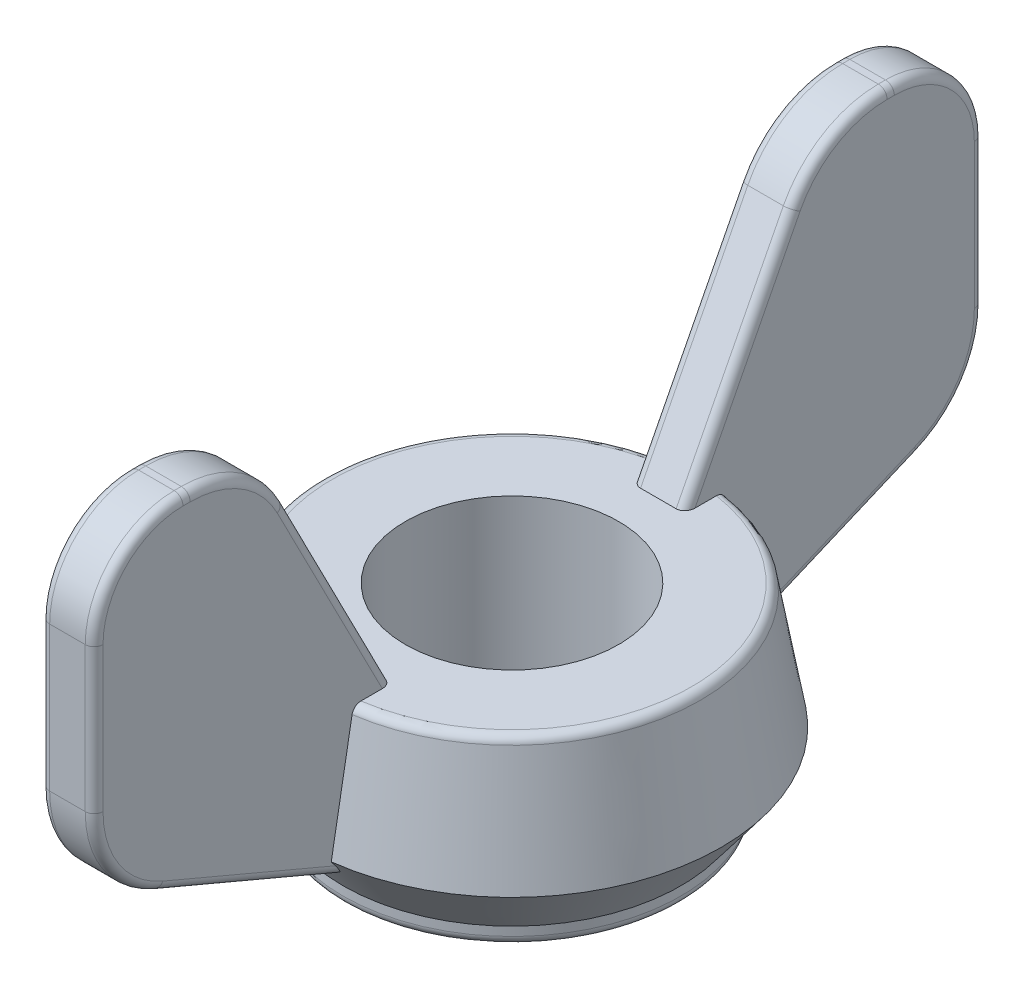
ISO-10303-21;
HEADER;
FILE_DESCRIPTION(('STEP AP214'),'2;1');
FILE_NAME('part.step','',(''),(''),'','','');
FILE_SCHEMA(('AUTOMOTIVE_DESIGN { 1 0 10303 214 1 1 1 1 }'));
ENDSEC;
DATA;
#1=APPLICATION_CONTEXT('core data for automotive mechanical design processes');
#2=APPLICATION_PROTOCOL_DEFINITION('international standard','automotive_design',2000,#1);
#3=PRODUCT_CONTEXT('',#1,'mechanical');
#4=PRODUCT('Part','Part','',(#3));
#5=PRODUCT_RELATED_PRODUCT_CATEGORY('part','',(#4));
#6=PRODUCT_DEFINITION_FORMATION('','',#4);
#7=PRODUCT_DEFINITION_CONTEXT('part definition',#1,'design');
#8=PRODUCT_DEFINITION('design','',#6,#7);
#9=PRODUCT_DEFINITION_SHAPE('','',#8);
#10=(LENGTH_UNIT() NAMED_UNIT(*) SI_UNIT(.MILLI.,.METRE.));
#11=(NAMED_UNIT(*) PLANE_ANGLE_UNIT() SI_UNIT($,.RADIAN.));
#12=(NAMED_UNIT(*) SI_UNIT($,.STERADIAN.) SOLID_ANGLE_UNIT());
#13=UNCERTAINTY_MEASURE_WITH_UNIT(LENGTH_MEASURE(1.E-05),#10,'distance_accuracy_value','');
#14=(GEOMETRIC_REPRESENTATION_CONTEXT(3) GLOBAL_UNCERTAINTY_ASSIGNED_CONTEXT((#13)) GLOBAL_UNIT_ASSIGNED_CONTEXT((#10,
#11,#12)) REPRESENTATION_CONTEXT('',''));
#15=CARTESIAN_POINT('',(0.,0.,0.));
#16=DIRECTION('',(0.,0.,1.));
#17=DIRECTION('',(1.,0.,0.));
#18=AXIS2_PLACEMENT_3D('',#15,#16,#17);
#19=CARTESIAN_POINT('',(0.,2.,0.));
#20=DIRECTION('',(0.,-1.,0.));
#21=DIRECTION('',(0.,0.,1.));
#22=AXIS2_PLACEMENT_3D('',#19,#20,#21);
#23=CONICAL_SURFACE('',#22,5.88033107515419,0.174532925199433);
#24=CARTESIAN_POINT('',(-0.75,10.1858576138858,4.3730959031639));
#25=CARTESIAN_POINT('',(-0.75,8.90406610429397,4.60238301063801));
#26=CARTESIAN_POINT('',(-0.75,7.62219537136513,4.83122643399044));
#27=CARTESIAN_POINT('',(-0.75,5.05833690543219,5.28825601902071));
#28=CARTESIAN_POINT('',(-0.75,3.77634917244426,5.51644218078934));
#29=CARTESIAN_POINT('',(-0.75,1.2122979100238,5.97238739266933));
#30=CARTESIAN_POINT('',(-0.75,-0.0697656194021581,6.20014644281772));
#31=CARTESIAN_POINT('',(-0.75,-2.63394938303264,6.65534614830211));
#32=CARTESIAN_POINT('',(-0.75,-3.91606961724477,6.88278680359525));
#33=CARTESIAN_POINT('',(-0.75,-5.19820842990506,7.11012257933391));
#34=B_SPLINE_CURVE_WITH_KNOTS('',3,(#24,#25,#26,#27,#28,#29,#30,#31,#32,#33),.UNSPECIFIED.,.F.,
.F.,(4,2,2,2,4),(0.,3.9064122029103,7.81282386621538,11.7192351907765,15.6256470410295),.UNSPECIFIED.);
#35=CARTESIAN_POINT('',(-0.75,5.29341204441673,5.2462753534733));
#36=VERTEX_POINT('',#35);
#37=CARTESIAN_POINT('',(-0.75,2.,5.83230602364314));
#38=VERTEX_POINT('',#37);
#39=EDGE_CURVE('E437',#36,#38,#34,.T.);
#40=ORIENTED_EDGE('',*,*,#39,.F.);
#41=CARTESIAN_POINT('',(0.,5.29341204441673,0.));
#42=DIRECTION('',(0.,-1.,0.));
#43=DIRECTION('',(0.,0.,-1.));
#44=AXIS2_PLACEMENT_3D('',#41,#42,#43);
#45=CIRCLE('',#44,5.2996136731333);
#46=CARTESIAN_POINT('',(-0.75,5.29341204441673,-5.2462753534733));
#47=VERTEX_POINT('',#46);
#48=EDGE_CURVE('E300',#36,#47,#45,.T.);
#49=ORIENTED_EDGE('',*,*,#48,.T.);
#50=CARTESIAN_POINT('',(-0.75,-5.19820842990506,-7.11012257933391));
#51=CARTESIAN_POINT('',(-0.75,-3.91606961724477,-6.88278680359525));
#52=CARTESIAN_POINT('',(-0.75,-2.63394938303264,-6.65534614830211));
#53=CARTESIAN_POINT('',(-0.75,-0.0697656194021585,-6.20014644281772));
#54=CARTESIAN_POINT('',(-0.75,1.2122979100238,-5.97238739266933));
#55=CARTESIAN_POINT('',(-0.75,3.77634917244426,-5.51644218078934));
#56=CARTESIAN_POINT('',(-0.75,5.05833690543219,-5.28825601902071));
#57=CARTESIAN_POINT('',(-0.75,7.62219537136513,-4.83122643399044));
#58=CARTESIAN_POINT('',(-0.75,8.90406610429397,-4.60238301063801));
#59=CARTESIAN_POINT('',(-0.75,10.1858576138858,-4.3730959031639));
#60=B_SPLINE_CURVE_WITH_KNOTS('',3,(#50,#51,#52,#53,#54,#55,#56,#57,#58,#59),.UNSPECIFIED.,.F.,
.F.,(4,2,2,2,4),(0.,3.90641185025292,7.81282317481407,11.7192348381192,15.6256470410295),.UNSPECIFIED.);
#61=CARTESIAN_POINT('',(-0.75,2.,-5.83230602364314));
#62=VERTEX_POINT('',#61);
#63=EDGE_CURVE('E284',#62,#47,#60,.T.);
#64=ORIENTED_EDGE('',*,*,#63,.F.);
#65=CARTESIAN_POINT('',(0.,2.,0.));
#66=DIRECTION('',(0.,1.,0.));
#67=DIRECTION('',(0.,0.,1.));
#68=AXIS2_PLACEMENT_3D('',#65,#66,#67);
#69=CIRCLE('',#68,5.88033107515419);
#70=EDGE_CURVE('E297',#62,#38,#69,.T.);
#71=ORIENTED_EDGE('',*,*,#70,.T.);
#72=EDGE_LOOP('',(#40,#49,#64,#71));
#73=FACE_BOUND('',#72,.T.);
#74=ADVANCED_FACE('F33',(#73),#23,.T.);
#75=CARTESIAN_POINT('',(0.,0.5,0.));
#76=DIRECTION('',(0.,-1.,0.));
#77=DIRECTION('',(0.,0.,-1.));
#78=AXIS2_PLACEMENT_3D('',#75,#76,#77);
#79=CYLINDRICAL_SURFACE('',#78,4.75);
#80=CARTESIAN_POINT('',(0.,0.25,0.));
#81=DIRECTION('',(0.,1.,0.));
#82=DIRECTION('',(0.,0.,1.));
#83=AXIS2_PLACEMENT_3D('',#80,#81,#82);
#84=CIRCLE('',#83,4.75);
#85=CARTESIAN_POINT('',(0.,0.25,4.75));
#86=VERTEX_POINT('',#85);
#87=EDGE_CURVE('E41',#86,#86,#84,.T.);
#88=ORIENTED_EDGE('',*,*,#87,.T.);
#89=EDGE_LOOP('',(#88));
#90=FACE_BOUND('',#89,.T.);
#91=CARTESIAN_POINT('',(0.,0.5,0.));
#92=DIRECTION('',(0.,1.,0.));
#93=DIRECTION('',(0.,0.,1.));
#94=AXIS2_PLACEMENT_3D('',#91,#92,#93);
#95=CIRCLE('',#94,4.75);
#96=CARTESIAN_POINT('',(0.,0.5,4.75));
#97=VERTEX_POINT('',#96);
#98=EDGE_CURVE('E312',#97,#97,#95,.T.);
#99=ORIENTED_EDGE('',*,*,#98,.F.);
#100=EDGE_LOOP('',(#99));
#101=FACE_BOUND('',#100,.T.);
#102=ADVANCED_FACE('F35',(#90,#101),#79,.T.);
#103=CARTESIAN_POINT('',(0.,0.,0.));
#104=DIRECTION('',(0.,1.,0.));
#105=DIRECTION('',(0.,0.,1.));
#106=AXIS2_PLACEMENT_3D('',#103,#104,#105);
#107=PLANE('',#106);
#108=CARTESIAN_POINT('',(0.,0.,0.));
#109=DIRECTION('',(0.,1.,0.));
#110=DIRECTION('',(0.,0.,1.));
#111=AXIS2_PLACEMENT_3D('',#108,#109,#110);
#112=CIRCLE('',#111,4.5);
#113=CARTESIAN_POINT('',(0.,0.,4.5));
#114=VERTEX_POINT('',#113);
#115=EDGE_CURVE('E11',#114,#114,#112,.F.);
#116=ORIENTED_EDGE('',*,*,#115,.T.);
#117=EDGE_LOOP('',(#116));
#118=FACE_BOUND('',#117,.T.);
#119=CARTESIAN_POINT('',(0.,0.,0.));
#120=DIRECTION('',(0.,1.,0.));
#121=DIRECTION('',(0.,0.,1.));
#122=AXIS2_PLACEMENT_3D('',#119,#120,#121);
#123=CIRCLE('',#122,3.);
#124=CARTESIAN_POINT('',(0.,0.,3.));
#125=VERTEX_POINT('',#124);
#126=EDGE_CURVE('E309',#125,#125,#123,.T.);
#127=ORIENTED_EDGE('',*,*,#126,.T.);
#128=EDGE_LOOP('',(#127));
#129=FACE_BOUND('',#128,.T.);
#130=ADVANCED_FACE('F722',(#118,#129),#107,.F.);
#131=CARTESIAN_POINT('',(0.,0.5,0.));
#132=DIRECTION('',(0.,1.,0.));
#133=DIRECTION('',(0.,0.,1.));
#134=AXIS2_PLACEMENT_3D('',#131,#132,#133);
#135=CONICAL_SURFACE('',#134,4.75,0.645771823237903);
#136=CARTESIAN_POINT('',(0.,-0.280483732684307,-1.32624906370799));
#137=DIRECTION('',(0.,0.92103048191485,0.3894905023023));
#138=DIRECTION('',(0.,0.3894905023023,-0.92103048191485));
#139=AXIS2_PLACEMENT_3D('',#136,#137,#138);
#140=ELLIPSE('',#139,4.518703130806,3.94489159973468);
#141=CARTESIAN_POINT('',(0.5,1.4653142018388,-5.45454770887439));
#142=VERTEX_POINT('',#141);
#143=CARTESIAN_POINT('',(-0.5,1.4653142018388,-5.45454770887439));
#144=VERTEX_POINT('',#143);
#145=EDGE_CURVE('E336',#142,#144,#140,.T.);
#146=ORIENTED_EDGE('',*,*,#145,.F.);
#147=CARTESIAN_POINT('',(0.5,1.4653142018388,-5.45454770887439));
#148=CARTESIAN_POINT('',(0.508637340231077,1.46478944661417,-5.45336002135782));
#149=CARTESIAN_POINT('',(0.517376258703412,1.46502373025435,-5.45271426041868));
#150=CARTESIAN_POINT('',(0.534612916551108,1.46689072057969,-5.45246411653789));
#151=CARTESIAN_POINT('',(0.543112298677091,1.46850627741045,-5.45284708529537));
#152=CARTESIAN_POINT('',(0.559641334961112,1.47300550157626,-5.45458388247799));
#153=CARTESIAN_POINT('',(0.567671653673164,1.4758873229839,-5.45593629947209));
#154=CARTESIAN_POINT('',(0.583109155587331,1.48267448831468,-5.45945161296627));
#155=CARTESIAN_POINT('',(0.590514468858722,1.48658276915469,-5.46161684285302));
#156=CARTESIAN_POINT('',(0.607486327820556,1.49692221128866,-5.4675986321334));
#157=CARTESIAN_POINT('',(0.616708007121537,1.50373315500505,-5.47172867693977));
#158=CARTESIAN_POINT('',(0.633822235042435,1.51835280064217,-5.48086286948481));
#159=CARTESIAN_POINT('',(0.641711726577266,1.52616372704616,-5.48586897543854));
#160=CARTESIAN_POINT('',(0.661587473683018,1.54828390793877,-5.50030489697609));
#161=CARTESIAN_POINT('',(0.672434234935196,1.56322326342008,-5.51032490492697));
#162=CARTESIAN_POINT('',(0.691453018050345,1.59404294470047,-5.53137597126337));
#163=CARTESIAN_POINT('',(0.699617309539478,1.60992583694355,-5.54240983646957));
#164=CARTESIAN_POINT('',(0.720111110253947,1.65646378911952,-5.57515458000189));
#165=CARTESIAN_POINT('',(0.729724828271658,1.68774256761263,-5.59766613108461));
#166=CARTESIAN_POINT('',(0.743392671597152,1.75065562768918,-5.64368760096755));
#167=CARTESIAN_POINT('',(0.747444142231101,1.78229007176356,-5.66719799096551));
#168=CARTESIAN_POINT('',(0.749702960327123,1.82507104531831,-5.69941589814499));
#169=CARTESIAN_POINT('',(0.74999364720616,1.83629136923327,-5.70790549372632));
#170=CARTESIAN_POINT('',(0.750000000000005,1.84748948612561,-5.71641567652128));
#171=B_SPLINE_CURVE_WITH_KNOTS('',3,(#147,#148,#149,#150,#151,#152,#153,#154,#155,#156,#157,
#158,#159,#160,#161,#162,#163,#164,#165,#166,#167,#168,#169,#170),.UNSPECIFIED.,.F.,.F.,(4,2,2,
2,2,2,2,2,2,2,2,4),(0.,0.0261292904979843,0.0519387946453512,0.0777107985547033,
0.103557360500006,0.139908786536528,0.176342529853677,0.239004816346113,0.301846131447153,
0.420347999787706,0.538906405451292,0.581110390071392),.UNSPECIFIED.);
#172=CARTESIAN_POINT('',(0.75,1.84748948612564,-5.71641567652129));
#173=VERTEX_POINT('',#172);
#174=EDGE_CURVE('E897',#142,#173,#171,.T.);
#175=ORIENTED_EDGE('',*,*,#174,.T.);
#176=CARTESIAN_POINT('',(0.75,-1.68720721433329,-3.00978311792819));
#177=CARTESIAN_POINT('',(0.75,-1.55500201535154,-3.11244585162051));
#178=CARTESIAN_POINT('',(0.75,-1.42265594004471,-3.214926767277));
#179=CARTESIAN_POINT('',(0.75,-1.15773930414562,-3.41959761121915));
#180=CARTESIAN_POINT('',(0.75,-1.02516874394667,-3.52178754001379));
#181=CARTESIAN_POINT('',(0.75,-0.627206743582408,-3.82802943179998));
#182=CARTESIAN_POINT('',(0.75,-0.361563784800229,-4.03175442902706));
#183=CARTESIAN_POINT('',(0.75,0.170140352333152,-4.43865354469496));
#184=CARTESIAN_POINT('',(0.75,0.43620152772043,-4.6418276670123));
#185=CARTESIAN_POINT('',(0.75,0.968608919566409,-5.04780276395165));
#186=CARTESIAN_POINT('',(0.75,1.23495513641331,-5.25060373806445));
#187=CARTESIAN_POINT('',(0.75,2.03428368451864,-5.85861631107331));
#188=CARTESIAN_POINT('',(0.75,2.56756031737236,-6.2634409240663));
#189=CARTESIAN_POINT('',(0.75,3.36779597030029,-6.87025815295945));
#190=CARTESIAN_POINT('',(0.75,3.63459550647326,-7.07246127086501));
#191=CARTESIAN_POINT('',(0.75,4.16828038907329,-7.47675404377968));
#192=CARTESIAN_POINT('',(0.75,4.43516573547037,-7.67884369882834));
#193=CARTESIAN_POINT('',(0.75,4.70208382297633,-7.88089013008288));
#194=B_SPLINE_CURVE_WITH_KNOTS('',3,(#176,#177,#178,#179,#180,#181,#182,#183,#184,#185,#186,
#187,#188,#189,#190,#191,#192,#193),.UNSPECIFIED.,.F.,.F.,(4,2,2,2,2,2,2,2,4),(0.,
0.502155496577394,1.00431011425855,2.00861479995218,3.0129123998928,4.01721136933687,
6.02579268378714,7.03008987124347,8.03438670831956),.UNSPECIFIED.);
#195=CARTESIAN_POINT('',(0.75,2.,-5.83230602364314));
#196=VERTEX_POINT('',#195);
#197=EDGE_CURVE('E421',#173,#196,#194,.T.);
#198=ORIENTED_EDGE('',*,*,#197,.T.);
#199=CARTESIAN_POINT('',(0.75,2.,5.83230602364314));
#200=VERTEX_POINT('',#199);
#201=EDGE_CURVE('E308',#200,#196,#69,.T.);
#202=ORIENTED_EDGE('',*,*,#201,.F.);
#203=CARTESIAN_POINT('',(0.75,4.48241104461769,7.71459081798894));
#204=CARTESIAN_POINT('',(0.75,4.2155117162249,7.5125190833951));
#205=CARTESIAN_POINT('',(0.75,3.9486472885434,7.31040128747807));
#206=CARTESIAN_POINT('',(0.75,3.41501042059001,6.90604407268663));
#207=CARTESIAN_POINT('',(0.75,3.1482379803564,6.70380465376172));
#208=CARTESIAN_POINT('',(0.75,2.34809655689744,6.09686322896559));
#209=CARTESIAN_POINT('',(0.75,1.81489916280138,5.69193479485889));
#210=CARTESIAN_POINT('',(0.75,1.01574509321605,5.08369254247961));
#211=CARTESIAN_POINT('',(0.75,0.749465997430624,4.88080244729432));
#212=CARTESIAN_POINT('',(0.75,0.217224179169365,4.47460859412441));
#213=CARTESIAN_POINT('',(0.75,-0.0487385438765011,4.27130483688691));
#214=CARTESIAN_POINT('',(0.75,-0.580193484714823,3.86407772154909));
#215=CARTESIAN_POINT('',(0.75,-0.84568569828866,3.66015435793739));
#216=CARTESIAN_POINT('',(0.75,-1.2433465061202,3.35351838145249));
#217=CARTESIAN_POINT('',(0.75,-1.37580425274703,3.25118092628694));
#218=CARTESIAN_POINT('',(0.75,-1.64045738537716,3.04616675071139));
#219=CARTESIAN_POINT('',(0.75,-1.77265277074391,2.94349002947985));
#220=CARTESIAN_POINT('',(0.75,-1.90468185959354,2.84059934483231));
#221=B_SPLINE_CURVE_WITH_KNOTS('',3,(#203,#204,#205,#206,#207,#208,#209,#210,#211,#212,#213,
#214,#215,#216,#217,#218,#219,#220),.UNSPECIFIED.,.F.,.F.,(4,2,2,2,2,2,2,2,4),(0.,
1.00429777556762,2.00859596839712,4.01717614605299,5.02147688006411,6.02577580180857,
7.0300836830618,7.53224063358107,8.0343988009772),.UNSPECIFIED.);
#222=CARTESIAN_POINT('',(0.75,1.84748948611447,5.71641567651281));
#223=VERTEX_POINT('',#222);
#224=EDGE_CURVE('E454',#200,#223,#221,.T.);
#225=ORIENTED_EDGE('',*,*,#224,.T.);
#226=CARTESIAN_POINT('',(0.75,1.84748948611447,5.71641567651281));
#227=CARTESIAN_POINT('',(0.749990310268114,1.83076482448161,5.70370546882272));
#228=CARTESIAN_POINT('',(0.749343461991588,1.81399328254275,5.69104353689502));
#229=CARTESIAN_POINT('',(0.746661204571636,1.78038174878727,5.66585025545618));
#230=CARTESIAN_POINT('',(0.74462142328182,1.76354170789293,5.65331944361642));
#231=CARTESIAN_POINT('',(0.739020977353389,1.72982419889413,5.62842914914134));
#232=CARTESIAN_POINT('',(0.735451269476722,1.71294711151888,5.61607114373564));
#233=CARTESIAN_POINT('',(0.726593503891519,1.67939870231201,5.59173199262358));
#234=CARTESIAN_POINT('',(0.721307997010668,1.66272711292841,5.5797503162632));
#235=CARTESIAN_POINT('',(0.710528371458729,1.63452603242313,5.55970896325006));
#236=CARTESIAN_POINT('',(0.705534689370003,1.62290110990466,5.55151535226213));
#237=CARTESIAN_POINT('',(0.69435782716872,1.59996066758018,5.53550251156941));
#238=CARTESIAN_POINT('',(0.688174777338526,1.58864511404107,5.52768324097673));
#239=CARTESIAN_POINT('',(0.67435457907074,1.56643014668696,5.5125217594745));
#240=CARTESIAN_POINT('',(0.666707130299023,1.55553438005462,5.50518345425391));
#241=CARTESIAN_POINT('',(0.649701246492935,1.53458148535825,5.49131745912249));
#242=CARTESIAN_POINT('',(0.640346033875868,1.52452282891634,5.48478828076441));
#243=CARTESIAN_POINT('',(0.623560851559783,1.50939643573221,5.4752445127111));
#244=CARTESIAN_POINT('',(0.61675524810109,1.50388721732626,5.47183861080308));
#245=CARTESIAN_POINT('',(0.602308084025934,1.49363645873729,5.46567652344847));
#246=CARTESIAN_POINT('',(0.594666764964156,1.4888946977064,5.46292015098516));
#247=CARTESIAN_POINT('',(0.578451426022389,1.4804102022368,5.45823177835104));
#248=CARTESIAN_POINT('',(0.569865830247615,1.47668240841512,5.45631187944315));
#249=CARTESIAN_POINT('',(0.552040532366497,1.4706695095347,5.45358981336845));
#250=CARTESIAN_POINT('',(0.542802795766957,1.46838025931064,5.45278442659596));
#251=CARTESIAN_POINT('',(0.527901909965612,1.46607386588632,5.45249594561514));
#252=CARTESIAN_POINT('',(0.52232478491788,1.46551010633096,5.45260630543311));
#253=CARTESIAN_POINT('',(0.511150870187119,1.46496899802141,5.45325569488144));
#254=CARTESIAN_POINT('',(0.50555407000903,1.46499333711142,5.45379595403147));
#255=CARTESIAN_POINT('',(0.500000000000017,1.4653142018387,5.45454770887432));
#256=B_SPLINE_CURVE_WITH_KNOTS('',3,(#226,#227,#228,#229,#230,#231,#232,#233,#234,#235,#236,
#237,#238,#239,#240,#241,#242,#243,#244,#245,#246,#247,#248,#249,#250,#251,#252,#253,#254,#255),
.UNSPECIFIED.,.F.,.F.,(4,2,2,2,2,2,2,2,2,2,2,2,2,2,4),(0.,0.0630216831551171,0.126242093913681,
0.189841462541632,0.253346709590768,0.298524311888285,0.343696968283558,0.38919987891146,
0.434617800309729,0.462732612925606,0.49083932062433,0.519340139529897,0.547758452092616,
0.564534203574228,0.581358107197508),.UNSPECIFIED.);
#257=CARTESIAN_POINT('',(0.5,1.4653142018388,5.45454770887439));
#258=VERTEX_POINT('',#257);
#259=EDGE_CURVE('E537',#223,#258,#256,.T.);
#260=ORIENTED_EDGE('',*,*,#259,.T.);
#261=CARTESIAN_POINT('',(0.,-0.280483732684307,1.32624906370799));
#262=DIRECTION('',(0.,0.92103048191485,-0.3894905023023));
#263=DIRECTION('',(0.,0.3894905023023,0.92103048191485));
#264=AXIS2_PLACEMENT_3D('',#261,#262,#263);
#265=ELLIPSE('',#264,4.518703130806,3.94489159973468);
#266=CARTESIAN_POINT('',(-0.5,1.4653142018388,5.45454770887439));
#267=VERTEX_POINT('',#266);
#268=EDGE_CURVE('E326',#267,#258,#265,.T.);
#269=ORIENTED_EDGE('',*,*,#268,.F.);
#270=CARTESIAN_POINT('',(-0.5,1.4653142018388,5.45454770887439));
#271=CARTESIAN_POINT('',(-0.508637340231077,1.46478944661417,5.45336002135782));
#272=CARTESIAN_POINT('',(-0.517376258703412,1.46502373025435,5.45271426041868));
#273=CARTESIAN_POINT('',(-0.534612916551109,1.46689072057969,5.45246411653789));
#274=CARTESIAN_POINT('',(-0.543112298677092,1.46850627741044,5.45284708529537));
#275=CARTESIAN_POINT('',(-0.559641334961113,1.47300550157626,5.45458388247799));
#276=CARTESIAN_POINT('',(-0.567671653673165,1.4758873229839,5.45593629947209));
#277=CARTESIAN_POINT('',(-0.583109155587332,1.48267448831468,5.45945161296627));
#278=CARTESIAN_POINT('',(-0.590514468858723,1.48658276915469,5.46161684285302));
#279=CARTESIAN_POINT('',(-0.607486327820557,1.49692221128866,5.4675986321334));
#280=CARTESIAN_POINT('',(-0.616708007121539,1.50373315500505,5.47172867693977));
#281=CARTESIAN_POINT('',(-0.633822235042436,1.51835280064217,5.48086286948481));
#282=CARTESIAN_POINT('',(-0.641711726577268,1.52616372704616,5.48586897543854));
#283=CARTESIAN_POINT('',(-0.661587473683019,1.54828390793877,5.50030489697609));
#284=CARTESIAN_POINT('',(-0.672434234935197,1.56322326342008,5.51032490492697));
#285=CARTESIAN_POINT('',(-0.691453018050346,1.59404294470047,5.53137597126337));
#286=CARTESIAN_POINT('',(-0.699617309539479,1.60992583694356,5.54240983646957));
#287=CARTESIAN_POINT('',(-0.72011111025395,1.65646378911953,5.5751545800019));
#288=CARTESIAN_POINT('',(-0.729724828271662,1.68774256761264,5.59766613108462));
#289=CARTESIAN_POINT('',(-0.743392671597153,1.75065562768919,5.64368760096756));
#290=CARTESIAN_POINT('',(-0.747444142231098,1.78229007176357,5.66719799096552));
#291=CARTESIAN_POINT('',(-0.749702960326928,1.82507104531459,5.69941589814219));
#292=CARTESIAN_POINT('',(-0.74999364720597,1.83629136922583,5.70790549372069));
#293=CARTESIAN_POINT('',(-0.750000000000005,1.84748948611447,5.71641567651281));
#294=B_SPLINE_CURVE_WITH_KNOTS('',3,(#270,#271,#272,#273,#274,#275,#276,#277,#278,#279,#280,
#281,#282,#283,#284,#285,#286,#287,#288,#289,#290,#291,#292,#293),.UNSPECIFIED.,.F.,.F.,(4,2,2,
2,2,2,2,2,2,2,2,4),(0.,0.0261292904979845,0.0519387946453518,0.0777107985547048,
0.103557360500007,0.13990878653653,0.176342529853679,0.239004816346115,0.301846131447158,
0.420347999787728,0.538906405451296,0.581110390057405),.UNSPECIFIED.);
#295=CARTESIAN_POINT('',(-0.75,1.84748948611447,5.71641567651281));
#296=VERTEX_POINT('',#295);
#297=EDGE_CURVE('E658',#267,#296,#294,.T.);
#298=ORIENTED_EDGE('',*,*,#297,.T.);
#299=CARTESIAN_POINT('',(-0.75,4.48241104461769,7.71459081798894));
#300=CARTESIAN_POINT('',(-0.75,4.2155117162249,7.5125190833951));
#301=CARTESIAN_POINT('',(-0.75,3.9486472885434,7.31040128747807));
#302=CARTESIAN_POINT('',(-0.75,3.41501042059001,6.90604407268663));
#303=CARTESIAN_POINT('',(-0.75,3.1482379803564,6.70380465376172));
#304=CARTESIAN_POINT('',(-0.75,2.34809655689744,6.09686322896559));
#305=CARTESIAN_POINT('',(-0.75,1.81489916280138,5.69193479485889));
#306=CARTESIAN_POINT('',(-0.75,1.01574509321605,5.08369254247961));
#307=CARTESIAN_POINT('',(-0.75,0.749465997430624,4.88080244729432));
#308=CARTESIAN_POINT('',(-0.75,0.217224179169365,4.47460859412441));
#309=CARTESIAN_POINT('',(-0.75,-0.0487385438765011,4.27130483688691));
#310=CARTESIAN_POINT('',(-0.75,-0.580193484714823,3.86407772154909));
#311=CARTESIAN_POINT('',(-0.75,-0.84568569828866,3.66015435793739));
#312=CARTESIAN_POINT('',(-0.75,-1.2433465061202,3.35351838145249));
#313=CARTESIAN_POINT('',(-0.75,-1.37580425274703,3.25118092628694));
#314=CARTESIAN_POINT('',(-0.75,-1.64045738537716,3.04616675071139));
#315=CARTESIAN_POINT('',(-0.75,-1.77265277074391,2.94349002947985));
#316=CARTESIAN_POINT('',(-0.75,-1.90468185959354,2.84059934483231));
#317=B_SPLINE_CURVE_WITH_KNOTS('',3,(#299,#300,#301,#302,#303,#304,#305,#306,#307,#308,#309,
#310,#311,#312,#313,#314,#315,#316),.UNSPECIFIED.,.F.,.F.,(4,2,2,2,2,2,2,2,4),(0.,
1.00429777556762,2.00859596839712,4.01717614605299,5.02147688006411,6.02577580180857,
7.0300836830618,7.53224063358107,8.0343988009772),.UNSPECIFIED.);
#318=EDGE_CURVE('E307',#38,#296,#317,.T.);
#319=ORIENTED_EDGE('',*,*,#318,.F.);
#320=ORIENTED_EDGE('',*,*,#70,.F.);
#321=CARTESIAN_POINT('',(-0.75,-1.68720721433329,-3.00978311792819));
#322=CARTESIAN_POINT('',(-0.75,-1.55500201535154,-3.11244585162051));
#323=CARTESIAN_POINT('',(-0.75,-1.42265594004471,-3.214926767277));
#324=CARTESIAN_POINT('',(-0.75,-1.15773930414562,-3.41959761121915));
#325=CARTESIAN_POINT('',(-0.75,-1.02516874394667,-3.52178754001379));
#326=CARTESIAN_POINT('',(-0.75,-0.627206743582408,-3.82802943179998));
#327=CARTESIAN_POINT('',(-0.75,-0.361563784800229,-4.03175442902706));
#328=CARTESIAN_POINT('',(-0.75,0.170140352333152,-4.43865354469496));
#329=CARTESIAN_POINT('',(-0.75,0.43620152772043,-4.6418276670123));
#330=CARTESIAN_POINT('',(-0.75,0.968608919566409,-5.04780276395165));
#331=CARTESIAN_POINT('',(-0.75,1.23495513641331,-5.25060373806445));
#332=CARTESIAN_POINT('',(-0.75,2.03428368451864,-5.85861631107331));
#333=CARTESIAN_POINT('',(-0.75,2.56756031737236,-6.2634409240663));
#334=CARTESIAN_POINT('',(-0.75,3.36779597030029,-6.87025815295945));
#335=CARTESIAN_POINT('',(-0.75,3.63459550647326,-7.07246127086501));
#336=CARTESIAN_POINT('',(-0.75,4.16828038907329,-7.47675404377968));
#337=CARTESIAN_POINT('',(-0.75,4.43516573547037,-7.67884369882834));
#338=CARTESIAN_POINT('',(-0.75,4.70208382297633,-7.88089013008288));
#339=B_SPLINE_CURVE_WITH_KNOTS('',3,(#321,#322,#323,#324,#325,#326,#327,#328,#329,#330,#331,
#332,#333,#334,#335,#336,#337,#338),.UNSPECIFIED.,.F.,.F.,(4,2,2,2,2,2,2,2,4),(0.,
0.502155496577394,1.00431011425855,2.00861479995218,3.0129123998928,4.01721136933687,
6.02579268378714,7.03008987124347,8.03438670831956),.UNSPECIFIED.);
#340=CARTESIAN_POINT('',(-0.75,1.84748948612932,-5.71641567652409));
#341=VERTEX_POINT('',#340);
#342=EDGE_CURVE('E280',#341,#62,#339,.T.);
#343=ORIENTED_EDGE('',*,*,#342,.F.);
#344=CARTESIAN_POINT('',(-0.75,1.84748948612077,-5.71641567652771));
#345=CARTESIAN_POINT('',(-0.749990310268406,1.83076482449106,-5.7037054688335));
#346=CARTESIAN_POINT('',(-0.749343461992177,1.8139932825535,-5.69104353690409));
#347=CARTESIAN_POINT('',(-0.746661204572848,1.78038174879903,-5.66585025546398));
#348=CARTESIAN_POINT('',(-0.744621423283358,1.76354170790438,-5.65331944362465));
#349=CARTESIAN_POINT('',(-0.739020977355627,1.7298241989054,-5.62842914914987));
#350=CARTESIAN_POINT('',(-0.735451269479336,1.71294711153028,-5.61607114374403));
#351=CARTESIAN_POINT('',(-0.726593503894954,1.67939870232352,-5.59173199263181));
#352=CARTESIAN_POINT('',(-0.721307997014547,1.66272711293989,-5.57975031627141));
#353=CARTESIAN_POINT('',(-0.710528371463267,1.63452603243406,-5.55970896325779));
#354=CARTESIAN_POINT('',(-0.705534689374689,1.62290110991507,-5.55151535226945));
#355=CARTESIAN_POINT('',(-0.694357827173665,1.59996066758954,-5.53550251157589));
#356=CARTESIAN_POINT('',(-0.688174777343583,1.58864511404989,-5.52768324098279));
#357=CARTESIAN_POINT('',(-0.674354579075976,1.56643014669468,-5.51252175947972));
#358=CARTESIAN_POINT('',(-0.666707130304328,1.55553438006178,-5.50518345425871));
#359=CARTESIAN_POINT('',(-0.649701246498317,1.53458148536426,-5.49131745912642));
#360=CARTESIAN_POINT('',(-0.64034603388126,1.52452282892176,-5.4847882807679));
#361=CARTESIAN_POINT('',(-0.623560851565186,1.50939643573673,-5.47524451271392));
#362=CARTESIAN_POINT('',(-0.616755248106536,1.50388721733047,-5.47183861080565));
#363=CARTESIAN_POINT('',(-0.602308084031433,1.49363645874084,-5.46567652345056));
#364=CARTESIAN_POINT('',(-0.594666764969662,1.48889469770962,-5.462920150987));
#365=CARTESIAN_POINT('',(-0.578451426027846,1.48041020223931,-5.45823177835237));
#366=CARTESIAN_POINT('',(-0.569865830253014,1.47668240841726,-5.45631187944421));
#367=CARTESIAN_POINT('',(-0.552040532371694,1.47066950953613,-5.453589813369));
#368=CARTESIAN_POINT('',(-0.542802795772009,1.46838025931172,-5.45278442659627));
#369=CARTESIAN_POINT('',(-0.527901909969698,1.46607386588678,-5.45249594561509));
#370=CARTESIAN_POINT('',(-0.522324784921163,1.46551010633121,-5.45260630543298));
#371=CARTESIAN_POINT('',(-0.511150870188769,1.4649689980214,-5.45325569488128));
#372=CARTESIAN_POINT('',(-0.505554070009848,1.46499333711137,-5.45379595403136));
#373=CARTESIAN_POINT('',(-0.500000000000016,1.4653142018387,-5.45454770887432));
#374=B_SPLINE_CURVE_WITH_KNOTS('',3,(#344,#345,#346,#347,#348,#349,#350,#351,#352,#353,#354,
#355,#356,#357,#358,#359,#360,#361,#362,#363,#364,#365,#366,#367,#368,#369,#370,#371,#372,#373),
.UNSPECIFIED.,.F.,.F.,(4,2,2,2,2,2,2,2,2,2,2,2,2,2,4),(0.,0.0630216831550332,0.126242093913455,
0.189841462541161,0.253346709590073,0.298524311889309,0.343696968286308,0.389199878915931,
0.434617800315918,0.462732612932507,0.490839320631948,0.519340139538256,0.547758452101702,
0.564534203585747,0.581358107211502),.UNSPECIFIED.);
#375=EDGE_CURVE('E374',#341,#144,#374,.T.);
#376=ORIENTED_EDGE('',*,*,#375,.T.);
#377=EDGE_LOOP('',(#146,#175,#198,#202,#225,#260,#269,#298,#319,#320,#343,#376));
#378=FACE_BOUND('',#377,.T.);
#379=ORIENTED_EDGE('',*,*,#98,.T.);
#380=EDGE_LOOP('',(#379));
#381=FACE_BOUND('',#380,.T.);
#382=ADVANCED_FACE('F304',(#378,#381),#135,.T.);
#383=CARTESIAN_POINT('',(0.75,-5.19820842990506,-7.11012257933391));
#384=CARTESIAN_POINT('',(0.75,-3.91606961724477,-6.88278680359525));
#385=CARTESIAN_POINT('',(0.75,-2.63394938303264,-6.65534614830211));
#386=CARTESIAN_POINT('',(0.75,-0.0697656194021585,-6.20014644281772));
#387=CARTESIAN_POINT('',(0.75,1.2122979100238,-5.97238739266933));
#388=CARTESIAN_POINT('',(0.75,3.77634917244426,-5.51644218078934));
#389=CARTESIAN_POINT('',(0.75,5.05833690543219,-5.28825601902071));
#390=CARTESIAN_POINT('',(0.75,7.62219537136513,-4.83122643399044));
#391=CARTESIAN_POINT('',(0.75,8.90406610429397,-4.60238301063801));
#392=CARTESIAN_POINT('',(0.75,10.1858576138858,-4.3730959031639));
#393=B_SPLINE_CURVE_WITH_KNOTS('',3,(#383,#384,#385,#386,#387,#388,#389,#390,#391,#392),
.UNSPECIFIED.,.F.,.F.,(4,2,2,2,4),(0.,3.90641185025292,7.81282317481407,11.7192348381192,
15.6256470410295),.UNSPECIFIED.);
#394=CARTESIAN_POINT('',(0.75,5.29341204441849,-5.24627535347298));
#395=VERTEX_POINT('',#394);
#396=EDGE_CURVE('E292',#196,#395,#393,.T.);
#397=ORIENTED_EDGE('',*,*,#396,.T.);
#398=CARTESIAN_POINT('',(0.,5.29341204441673,0.));
#399=DIRECTION('',(0.,-1.,0.));
#400=DIRECTION('',(0.,0.,-1.));
#401=AXIS2_PLACEMENT_3D('',#398,#399,#400);
#402=CIRCLE('',#401,5.2996136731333);
#403=CARTESIAN_POINT('',(0.75,5.29341204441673,5.2462753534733));
#404=VERTEX_POINT('',#403);
#405=EDGE_CURVE('E553',#395,#404,#402,.T.);
#406=ORIENTED_EDGE('',*,*,#405,.T.);
#407=CARTESIAN_POINT('',(0.75,10.1858576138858,4.3730959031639));
#408=CARTESIAN_POINT('',(0.75,8.90406610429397,4.60238301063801));
#409=CARTESIAN_POINT('',(0.75,7.62219537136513,4.83122643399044));
#410=CARTESIAN_POINT('',(0.75,5.05833690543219,5.28825601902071));
#411=CARTESIAN_POINT('',(0.75,3.77634917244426,5.51644218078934));
#412=CARTESIAN_POINT('',(0.75,1.2122979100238,5.97238739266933));
#413=CARTESIAN_POINT('',(0.75,-0.0697656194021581,6.20014644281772));
#414=CARTESIAN_POINT('',(0.75,-2.63394938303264,6.65534614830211));
#415=CARTESIAN_POINT('',(0.75,-3.91606961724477,6.88278680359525));
#416=CARTESIAN_POINT('',(0.75,-5.19820842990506,7.11012257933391));
#417=B_SPLINE_CURVE_WITH_KNOTS('',3,(#407,#408,#409,#410,#411,#412,#413,#414,#415,#416),
.UNSPECIFIED.,.F.,.F.,(4,2,2,2,4),(0.,3.9064122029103,7.81282386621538,11.7192351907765,
15.6256470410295),.UNSPECIFIED.);
#418=EDGE_CURVE('E447',#404,#200,#417,.T.);
#419=ORIENTED_EDGE('',*,*,#418,.T.);
#420=ORIENTED_EDGE('',*,*,#201,.T.);
#421=EDGE_LOOP('',(#397,#406,#419,#420));
#422=FACE_BOUND('',#421,.T.);
#423=ADVANCED_FACE('F427',(#422),#23,.T.);
#424=CARTESIAN_POINT('',(0.,5.5,0.));
#425=DIRECTION('',(0.,1.,0.));
#426=DIRECTION('',(0.,0.,1.));
#427=AXIS2_PLACEMENT_3D('',#424,#425,#426);
#428=PLANE('',#427);
#429=DIRECTION('',(0.,0.,-1.));
#430=VECTOR('',#429,1.);
#431=CARTESIAN_POINT('',(0.75,5.5,0.));
#432=LINE('',#431,#430);
#433=CARTESIAN_POINT('',(0.75,5.5,4.99744636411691));
#434=VERTEX_POINT('',#433);
#435=CARTESIAN_POINT('',(0.75,5.5,4.39613215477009));
#436=VERTEX_POINT('',#435);
#437=EDGE_CURVE('E324',#434,#436,#432,.T.);
#438=ORIENTED_EDGE('',*,*,#437,.F.);
#439=CARTESIAN_POINT('',(0.,5.5,0.));
#440=DIRECTION('',(0.,1.,0.));
#441=DIRECTION('',(0.,0.,1.));
#442=AXIS2_PLACEMENT_3D('',#439,#440,#441);
#443=CIRCLE('',#442,5.05341173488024);
#444=CARTESIAN_POINT('',(0.75,5.5,-4.99744636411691));
#445=VERTEX_POINT('',#444);
#446=EDGE_CURVE('E550',#434,#445,#443,.T.);
#447=ORIENTED_EDGE('',*,*,#446,.T.);
#448=DIRECTION('',(0.,0.,-1.));
#449=VECTOR('',#448,1.);
#450=CARTESIAN_POINT('',(0.75,5.5,0.));
#451=LINE('',#450,#449);
#452=CARTESIAN_POINT('',(0.75,5.5,-4.39613215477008));
#453=VERTEX_POINT('',#452);
#454=EDGE_CURVE('E333',#453,#445,#451,.T.);
#455=ORIENTED_EDGE('',*,*,#454,.F.);
#456=CARTESIAN_POINT('',(0.5,5.5,-4.39613215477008));
#457=DIRECTION('',(0.,1.,0.));
#458=DIRECTION('',(0.,0.,-1.));
#459=AXIS2_PLACEMENT_3D('',#456,#457,#458);
#460=ELLIPSE('',#459,0.281029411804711,0.25);
#461=CARTESIAN_POINT('',(0.5,5.5,-4.11510274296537));
#462=VERTEX_POINT('',#461);
#463=EDGE_CURVE('E895',#453,#462,#460,.F.);
#464=ORIENTED_EDGE('',*,*,#463,.T.);
#465=DIRECTION('',(-1.,0.,0.));
#466=VECTOR('',#465,1.);
#467=CARTESIAN_POINT('',(0.,5.5,-4.11510274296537));
#468=LINE('',#467,#466);
#469=CARTESIAN_POINT('',(-0.5,5.5,-4.11510274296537));
#470=VERTEX_POINT('',#469);
#471=EDGE_CURVE('E331',#462,#470,#468,.T.);
#472=ORIENTED_EDGE('',*,*,#471,.T.);
#473=CARTESIAN_POINT('',(-0.5,5.5,-4.39613215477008));
#474=DIRECTION('',(0.,1.,0.));
#475=DIRECTION('',(0.,0.,1.));
#476=AXIS2_PLACEMENT_3D('',#473,#474,#475);
#477=ELLIPSE('',#476,0.281029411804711,0.25);
#478=CARTESIAN_POINT('',(-0.75,5.5,-4.39613215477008));
#479=VERTEX_POINT('',#478);
#480=EDGE_CURVE('E372',#470,#479,#477,.F.);
#481=ORIENTED_EDGE('',*,*,#480,.T.);
#482=DIRECTION('',(0.,0.,-1.));
#483=VECTOR('',#482,1.);
#484=CARTESIAN_POINT('',(-0.75,5.5,0.));
#485=LINE('',#484,#483);
#486=CARTESIAN_POINT('',(-0.75,5.5,-4.99744636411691));
#487=VERTEX_POINT('',#486);
#488=EDGE_CURVE('E328',#479,#487,#485,.T.);
#489=ORIENTED_EDGE('',*,*,#488,.T.);
#490=CARTESIAN_POINT('',(0.,5.5,0.));
#491=DIRECTION('',(0.,1.,0.));
#492=DIRECTION('',(0.,0.,1.));
#493=AXIS2_PLACEMENT_3D('',#490,#491,#492);
#494=CIRCLE('',#493,5.05341173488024);
#495=CARTESIAN_POINT('',(-0.75,5.5,4.99744636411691));
#496=VERTEX_POINT('',#495);
#497=EDGE_CURVE('E545',#487,#496,#494,.T.);
#498=ORIENTED_EDGE('',*,*,#497,.T.);
#499=DIRECTION('',(0.,0.,-1.));
#500=VECTOR('',#499,1.);
#501=CARTESIAN_POINT('',(-0.75,5.5,0.));
#502=LINE('',#501,#500);
#503=CARTESIAN_POINT('',(-0.75,5.5,4.39613215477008));
#504=VERTEX_POINT('',#503);
#505=EDGE_CURVE('E320',#496,#504,#502,.T.);
#506=ORIENTED_EDGE('',*,*,#505,.T.);
#507=CARTESIAN_POINT('',(-0.5,5.5,4.39613215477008));
#508=DIRECTION('',(0.,1.,0.));
#509=DIRECTION('',(0.,0.,1.));
#510=AXIS2_PLACEMENT_3D('',#507,#508,#509);
#511=ELLIPSE('',#510,0.281029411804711,0.25);
#512=CARTESIAN_POINT('',(-0.5,5.5,4.11510274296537));
#513=VERTEX_POINT('',#512);
#514=EDGE_CURVE('E48',#504,#513,#511,.F.);
#515=ORIENTED_EDGE('',*,*,#514,.T.);
#516=DIRECTION('',(1.,0.,0.));
#517=VECTOR('',#516,1.);
#518=CARTESIAN_POINT('',(0.,5.5,4.11510274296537));
#519=LINE('',#518,#517);
#520=CARTESIAN_POINT('',(0.5,5.5,4.11510274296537));
#521=VERTEX_POINT('',#520);
#522=EDGE_CURVE('E322',#513,#521,#519,.T.);
#523=ORIENTED_EDGE('',*,*,#522,.T.);
#524=CARTESIAN_POINT('',(0.5,5.5,4.39613215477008));
#525=DIRECTION('',(0.,1.,0.));
#526=DIRECTION('',(0.,0.,-1.));
#527=AXIS2_PLACEMENT_3D('',#524,#525,#526);
#528=ELLIPSE('',#527,0.281029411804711,0.25);
#529=EDGE_CURVE('E546',#521,#436,#528,.F.);
#530=ORIENTED_EDGE('',*,*,#529,.T.);
#531=EDGE_LOOP('',(#438,#447,#455,#464,#472,#481,#489,#498,#506,#515,#523,#530));
#532=FACE_BOUND('',#531,.T.);
#533=CARTESIAN_POINT('',(0.,5.5,0.));
#534=DIRECTION('',(0.,1.,0.));
#535=DIRECTION('',(0.,0.,1.));
#536=AXIS2_PLACEMENT_3D('',#533,#534,#535);
#537=CIRCLE('',#536,3.);
#538=CARTESIAN_POINT('',(0.,5.5,3.));
#539=VERTEX_POINT('',#538);
#540=EDGE_CURVE('E314',#539,#539,#537,.T.);
#541=ORIENTED_EDGE('',*,*,#540,.F.);
#542=EDGE_LOOP('',(#541));
#543=FACE_BOUND('',#542,.T.);
#544=ADVANCED_FACE('F431',(#532,#543),#428,.T.);
#545=CARTESIAN_POINT('',(0.,0.,0.));
#546=DIRECTION('',(0.,1.,0.));
#547=DIRECTION('',(0.,0.,1.));
#548=AXIS2_PLACEMENT_3D('',#545,#546,#547);
#549=CYLINDRICAL_SURFACE('',#548,3.);
#550=ORIENTED_EDGE('',*,*,#126,.F.);
#551=EDGE_LOOP('',(#550));
#552=FACE_BOUND('',#551,.T.);
#553=ORIENTED_EDGE('',*,*,#540,.T.);
#554=EDGE_LOOP('',(#553));
#555=FACE_BOUND('',#554,.T.);
#556=ADVANCED_FACE('F742',(#552,#555),#549,.F.);
#557=CARTESIAN_POINT('',(0.75,1.13301542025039,4.66875882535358));
#558=DIRECTION('',(0.,0.92103048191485,-0.3894905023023));
#559=DIRECTION('',(0.,0.3894905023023,0.921030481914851));
#560=AXIS2_PLACEMENT_3D('',#557,#558,#559);
#561=PLANE('',#560);
#562=DIRECTION('',(-1.,0.,0.));
#563=VECTOR('',#562,1.);
#564=CARTESIAN_POINT('',(0.75,3.6702073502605,10.6684715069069));
#565=LINE('',#564,#563);
#566=CARTESIAN_POINT('',(0.5,3.6702073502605,10.6684715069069));
#567=VERTEX_POINT('',#566);
#568=CARTESIAN_POINT('',(-0.5,3.6702073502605,10.6684715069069));
#569=VERTEX_POINT('',#568);
#570=EDGE_CURVE('E598',#567,#569,#565,.T.);
#571=ORIENTED_EDGE('',*,*,#570,.T.);
#572=DIRECTION('',(0.,-0.3894905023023,-0.921030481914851));
#573=VECTOR('',#572,1.);
#574=CARTESIAN_POINT('',(-0.5,1.13301542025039,4.66875882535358));
#575=LINE('',#574,#573);
#576=EDGE_CURVE('E662',#569,#267,#575,.T.);
#577=ORIENTED_EDGE('',*,*,#576,.T.);
#578=ORIENTED_EDGE('',*,*,#268,.T.);
#579=DIRECTION('',(0.,-0.3894905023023,-0.921030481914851));
#580=VECTOR('',#579,1.);
#581=CARTESIAN_POINT('',(0.5,3.6702073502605,10.6684715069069));
#582=LINE('',#581,#580);
#583=EDGE_CURVE('E571',#258,#567,#582,.F.);
#584=ORIENTED_EDGE('',*,*,#583,.T.);
#585=EDGE_LOOP('',(#571,#577,#578,#584));
#586=FACE_BOUND('',#585,.T.);
#587=ADVANCED_FACE('F468',(#586),#561,.F.);
#588=CARTESIAN_POINT('',(0.75,6.43329879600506,9.5));
#589=DIRECTION('',(1.,0.,0.));
#590=DIRECTION('',(0.,0.,-1.));
#591=AXIS2_PLACEMENT_3D('',#588,#589,#590);
#592=PLANE('',#591);
#593=ORIENTED_EDGE('',*,*,#418,.F.);
#594=CARTESIAN_POINT('',(0.75,5.29341204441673,5.2462753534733));
#595=CARTESIAN_POINT('',(0.75,5.3072022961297,5.2438316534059));
#596=CARTESIAN_POINT('',(0.75,5.32077507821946,5.24019581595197));
#597=CARTESIAN_POINT('',(0.75,5.34710650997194,5.23070590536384));
#598=CARTESIAN_POINT('',(0.75,5.35986599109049,5.22485414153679));
#599=CARTESIAN_POINT('',(0.75,5.3842258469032,5.21109038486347));
#600=CARTESIAN_POINT('',(0.75,5.39582583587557,5.20317770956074));
#601=CARTESIAN_POINT('',(0.75,5.41754061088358,5.18553078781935));
#602=CARTESIAN_POINT('',(0.75,5.42765569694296,5.17579691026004));
#603=CARTESIAN_POINT('',(0.75,5.4461835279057,5.1547244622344));
#604=CARTESIAN_POINT('',(0.75,5.45458602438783,5.14337688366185));
#605=CARTESIAN_POINT('',(0.75,5.46939445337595,5.11943612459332));
#606=CARTESIAN_POINT('',(0.75,5.47579904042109,5.10684211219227));
#607=CARTESIAN_POINT('',(0.75,5.48649526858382,5.08062728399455));
#608=CARTESIAN_POINT('',(0.75,5.49076296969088,5.0669967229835));
#609=CARTESIAN_POINT('',(0.75,5.49695964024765,5.03923682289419));
#610=CARTESIAN_POINT('',(0.75,5.49889356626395,5.02510860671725));
#611=CARTESIAN_POINT('',(0.75,5.49988178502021,5.00644026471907));
#612=CARTESIAN_POINT('',(0.75,5.50000071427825,5.00194222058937));
#613=CARTESIAN_POINT('',(0.75,5.5,4.99744636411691));
#614=B_SPLINE_CURVE_WITH_KNOTS('',3,(#594,#595,#596,#597,#598,#599,#600,#601,#602,#603,#604,
#605,#606,#607,#608,#609,#610,#611,#612,#613),.UNSPECIFIED.,.F.,.F.,(4,2,2,2,2,2,2,2,2,4),(0.,
0.0419566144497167,0.0838696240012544,0.125796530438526,0.167714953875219,0.209877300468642,
0.252067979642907,0.294721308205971,0.337283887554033,0.35077583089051),.UNSPECIFIED.);
#615=EDGE_CURVE('E476',#404,#434,#614,.T.);
#616=ORIENTED_EDGE('',*,*,#615,.T.);
#617=ORIENTED_EDGE('',*,*,#437,.T.);
#618=DIRECTION('',(0.,0.889586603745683,0.456766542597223));
#619=VECTOR('',#618,1.);
#620=CARTESIAN_POINT('',(0.75,11.2561079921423,7.35165951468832));
#621=LINE('',#620,#619);
#622=CARTESIAN_POINT('',(0.75,11.2561079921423,7.35165951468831));
#623=VERTEX_POINT('',#622);
#624=EDGE_CURVE('E573',#436,#623,#621,.T.);
#625=ORIENTED_EDGE('',*,*,#624,.T.);
#626=CARTESIAN_POINT('',(0.75,10.,9.79802267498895));
#627=DIRECTION('',(1.,0.,0.));
#628=DIRECTION('',(0.,0.,-1.));
#629=AXIS2_PLACEMENT_3D('',#626,#627,#628);
#630=CIRCLE('',#629,2.75);
#631=CARTESIAN_POINT('',(0.75,12.75,9.79802267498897));
#632=VERTEX_POINT('',#631);
#633=EDGE_CURVE('E578',#623,#632,#630,.T.);
#634=ORIENTED_EDGE('',*,*,#633,.T.);
#635=DIRECTION('',(0.,0.,1.));
#636=VECTOR('',#635,1.);
#637=CARTESIAN_POINT('',(0.75,12.75,9.99999999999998));
#638=LINE('',#637,#636);
#639=CARTESIAN_POINT('',(0.75,12.75,9.99999999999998));
#640=VERTEX_POINT('',#639);
#641=EDGE_CURVE('E582',#632,#640,#638,.T.);
#642=ORIENTED_EDGE('',*,*,#641,.T.);
#643=CARTESIAN_POINT('',(0.75,10.5,10.));
#644=DIRECTION('',(1.,0.,0.));
#645=DIRECTION('',(0.,0.,-1.));
#646=AXIS2_PLACEMENT_3D('',#643,#644,#645);
#647=CIRCLE('',#646,2.25);
#648=CARTESIAN_POINT('',(0.75,10.5,12.25));
#649=VERTEX_POINT('',#648);
#650=EDGE_CURVE('E1004',#640,#649,#647,.T.);
#651=ORIENTED_EDGE('',*,*,#650,.T.);
#652=DIRECTION('',(0.,-1.,0.));
#653=VECTOR('',#652,1.);
#654=CARTESIAN_POINT('',(0.75,6.43329879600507,12.25));
#655=LINE('',#654,#653);
#656=CARTESIAN_POINT('',(0.75,6.43329879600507,12.25));
#657=VERTEX_POINT('',#656);
#658=EDGE_CURVE('E1005',#649,#657,#655,.T.);
#659=ORIENTED_EDGE('',*,*,#658,.T.);
#660=CARTESIAN_POINT('',(0.75,6.43329879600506,9.5));
#661=DIRECTION('',(1.,0.,0.));
#662=DIRECTION('',(0.,0.,-1.));
#663=AXIS2_PLACEMENT_3D('',#660,#661,#662);
#664=CIRCLE('',#663,2.75);
#665=CARTESIAN_POINT('',(0.75,3.90046497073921,10.5710988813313));
#666=VERTEX_POINT('',#665);
#667=EDGE_CURVE('E622',#657,#666,#664,.T.);
#668=ORIENTED_EDGE('',*,*,#667,.T.);
#669=DIRECTION('',(0.,-0.3894905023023,-0.921030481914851));
#670=VECTOR('',#669,1.);
#671=CARTESIAN_POINT('',(0.75,1.67766534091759,5.31483152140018));
#672=LINE('',#671,#670);
#673=EDGE_CURVE('E614',#666,#223,#672,.T.);
#674=ORIENTED_EDGE('',*,*,#673,.T.);
#675=ORIENTED_EDGE('',*,*,#224,.F.);
#676=EDGE_LOOP('',(#593,#616,#617,#625,#634,#642,#651,#659,#668,#674,#675));
#677=FACE_BOUND('',#676,.T.);
#678=ADVANCED_FACE('F463',(#677),#592,.T.);
#679=CARTESIAN_POINT('',(-0.75,6.43329879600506,9.5));
#680=DIRECTION('',(1.,0.,0.));
#681=DIRECTION('',(0.,0.,-1.));
#682=AXIS2_PLACEMENT_3D('',#679,#680,#681);
#683=PLANE('',#682);
#684=ORIENTED_EDGE('',*,*,#318,.T.);
#685=DIRECTION('',(0.,-0.3894905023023,-0.921030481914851));
#686=VECTOR('',#685,1.);
#687=CARTESIAN_POINT('',(-0.75,3.90046497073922,10.5710988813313));
#688=LINE('',#687,#686);
#689=CARTESIAN_POINT('',(-0.75,3.90046497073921,10.5710988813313));
#690=VERTEX_POINT('',#689);
#691=EDGE_CURVE('E653',#296,#690,#688,.F.);
#692=ORIENTED_EDGE('',*,*,#691,.T.);
#693=CARTESIAN_POINT('',(-0.75,6.43329879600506,9.5));
#694=DIRECTION('',(1.,0.,0.));
#695=DIRECTION('',(0.,0.,-1.));
#696=AXIS2_PLACEMENT_3D('',#693,#694,#695);
#697=CIRCLE('',#696,2.75);
#698=CARTESIAN_POINT('',(-0.75,6.43329879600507,12.25));
#699=VERTEX_POINT('',#698);
#700=EDGE_CURVE('E663',#690,#699,#697,.F.);
#701=ORIENTED_EDGE('',*,*,#700,.T.);
#702=DIRECTION('',(0.,-1.,0.));
#703=VECTOR('',#702,1.);
#704=CARTESIAN_POINT('',(-0.75,6.43329879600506,12.25));
#705=LINE('',#704,#703);
#706=CARTESIAN_POINT('',(-0.75,10.5,12.25));
#707=VERTEX_POINT('',#706);
#708=EDGE_CURVE('E666',#699,#707,#705,.F.);
#709=ORIENTED_EDGE('',*,*,#708,.T.);
#710=CARTESIAN_POINT('',(-0.75,10.5,10.));
#711=DIRECTION('',(1.,0.,0.));
#712=DIRECTION('',(0.,0.,-1.));
#713=AXIS2_PLACEMENT_3D('',#710,#711,#712);
#714=CIRCLE('',#713,2.25);
#715=CARTESIAN_POINT('',(-0.75,12.75,9.99999999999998));
#716=VERTEX_POINT('',#715);
#717=EDGE_CURVE('E969',#707,#716,#714,.F.);
#718=ORIENTED_EDGE('',*,*,#717,.T.);
#719=DIRECTION('',(0.,0.,1.));
#720=VECTOR('',#719,1.);
#721=CARTESIAN_POINT('',(-0.75,12.75,9.5));
#722=LINE('',#721,#720);
#723=CARTESIAN_POINT('',(-0.75,12.75,9.79802267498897));
#724=VERTEX_POINT('',#723);
#725=EDGE_CURVE('E967',#716,#724,#722,.F.);
#726=ORIENTED_EDGE('',*,*,#725,.T.);
#727=CARTESIAN_POINT('',(-0.75,10.,9.79802267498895));
#728=DIRECTION('',(1.,0.,0.));
#729=DIRECTION('',(0.,0.,-1.));
#730=AXIS2_PLACEMENT_3D('',#727,#728,#729);
#731=CIRCLE('',#730,2.75);
#732=CARTESIAN_POINT('',(-0.75,11.2561079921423,7.35165951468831));
#733=VERTEX_POINT('',#732);
#734=EDGE_CURVE('E965',#724,#733,#731,.F.);
#735=ORIENTED_EDGE('',*,*,#734,.T.);
#736=DIRECTION('',(0.,0.889586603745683,0.456766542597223));
#737=VECTOR('',#736,1.);
#738=CARTESIAN_POINT('',(-0.75,8.31245133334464,5.84021153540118));
#739=LINE('',#738,#737);
#740=EDGE_CURVE('E957',#733,#504,#739,.F.);
#741=ORIENTED_EDGE('',*,*,#740,.T.);
#742=ORIENTED_EDGE('',*,*,#505,.F.);
#743=CARTESIAN_POINT('',(-0.75,5.5,4.99744636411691));
#744=CARTESIAN_POINT('',(-0.75,5.50001145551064,5.01177194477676));
#745=CARTESIAN_POINT('',(-0.75,5.498796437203,5.0260950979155));
#746=CARTESIAN_POINT('',(-0.75,5.49399429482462,5.05433785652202));
#747=CARTESIAN_POINT('',(-0.75,5.49040726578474,5.06825747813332));
#748=CARTESIAN_POINT('',(-0.75,5.48093936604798,5.09530302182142));
#749=CARTESIAN_POINT('',(-0.75,5.47505725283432,5.10842850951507));
#750=CARTESIAN_POINT('',(-0.75,5.46116504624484,5.13349157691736));
#751=CARTESIAN_POINT('',(-0.75,5.45315610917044,5.1454297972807));
#752=CARTESIAN_POINT('',(-0.75,5.43527690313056,5.16771342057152));
#753=CARTESIAN_POINT('',(-0.75,5.42541704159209,5.17806716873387));
#754=CARTESIAN_POINT('',(-0.75,5.40408011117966,5.19695758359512));
#755=CARTESIAN_POINT('',(-0.75,5.39260229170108,5.20549340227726));
#756=CARTESIAN_POINT('',(-0.75,5.36719795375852,5.22119304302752));
#757=CARTESIAN_POINT('',(-0.75,5.35314235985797,5.22814908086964));
#758=CARTESIAN_POINT('',(-0.75,5.32395409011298,5.23933103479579));
#759=CARTESIAN_POINT('',(-0.75,5.30881936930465,5.24355160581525));
#760=CARTESIAN_POINT('',(-0.75,5.29341204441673,5.2462753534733));
#761=B_SPLINE_CURVE_WITH_KNOTS('',3,(#743,#744,#745,#746,#747,#748,#749,#750,#751,#752,#753,
#754,#755,#756,#757,#758,#759,#760),.UNSPECIFIED.,.F.,.F.,(4,2,2,2,2,2,2,2,4),(0.,
0.0429220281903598,0.0858423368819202,0.128785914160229,0.171706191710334,0.214391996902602,
0.257097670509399,0.303866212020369,0.350725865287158),.UNSPECIFIED.);
#762=EDGE_CURVE('E484',#496,#36,#761,.T.);
#763=ORIENTED_EDGE('',*,*,#762,.T.);
#764=ORIENTED_EDGE('',*,*,#39,.T.);
#765=EDGE_LOOP('',(#684,#692,#701,#709,#718,#726,#735,#741,#742,#763,#764));
#766=FACE_BOUND('',#765,.T.);
#767=ADVANCED_FACE('F467',(#766),#683,.F.);
#768=CARTESIAN_POINT('',(0.75,5.39219770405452,4.05975064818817));
#769=DIRECTION('',(0.,-0.456766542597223,0.889586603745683));
#770=DIRECTION('',(0.,-0.889586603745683,-0.456766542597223));
#771=AXIS2_PLACEMENT_3D('',#768,#769,#770);
#772=PLANE('',#771);
#773=ORIENTED_EDGE('',*,*,#522,.F.);
#774=DIRECTION('',(0.,0.889586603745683,0.456766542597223));
#775=VECTOR('',#774,1.);
#776=CARTESIAN_POINT('',(-0.5,5.39219770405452,4.05975064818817));
#777=LINE('',#776,#775);
#778=CARTESIAN_POINT('',(-0.5,11.3702996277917,7.12926286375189));
#779=VERTEX_POINT('',#778);
#780=EDGE_CURVE('E55',#513,#779,#777,.T.);
#781=ORIENTED_EDGE('',*,*,#780,.T.);
#782=DIRECTION('',(-1.,0.,0.));
#783=VECTOR('',#782,1.);
#784=CARTESIAN_POINT('',(0.75,11.3702996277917,7.12926286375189));
#785=LINE('',#784,#783);
#786=CARTESIAN_POINT('',(0.5,11.3702996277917,7.12926286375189));
#787=VERTEX_POINT('',#786);
#788=EDGE_CURVE('E648',#787,#779,#785,.T.);
#789=ORIENTED_EDGE('',*,*,#788,.F.);
#790=DIRECTION('',(0.,0.889586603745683,0.456766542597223));
#791=VECTOR('',#790,1.);
#792=CARTESIAN_POINT('',(0.5,5.5,4.11510274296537));
#793=LINE('',#792,#791);
#794=EDGE_CURVE('E587',#787,#521,#793,.F.);
#795=ORIENTED_EDGE('',*,*,#794,.T.);
#796=EDGE_LOOP('',(#773,#781,#789,#795));
#797=FACE_BOUND('',#796,.T.);
#798=ADVANCED_FACE('F749',(#797),#772,.F.);
#799=CARTESIAN_POINT('',(0.75,10.,9.79802267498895));
#800=DIRECTION('',(-1.,0.,0.));
#801=DIRECTION('',(0.,0.,1.));
#802=AXIS2_PLACEMENT_3D('',#799,#800,#801);
#803=CYLINDRICAL_SURFACE('',#802,3.);
#804=ORIENTED_EDGE('',*,*,#788,.T.);
#805=CARTESIAN_POINT('',(-0.5,10.,9.79802267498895));
#806=DIRECTION('',(1.,0.,0.));
#807=DIRECTION('',(0.,0.,-1.));
#808=AXIS2_PLACEMENT_3D('',#805,#806,#807);
#809=CIRCLE('',#808,3.);
#810=CARTESIAN_POINT('',(-0.5,13.,9.79802267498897));
#811=VERTEX_POINT('',#810);
#812=EDGE_CURVE('E674',#779,#811,#809,.T.);
#813=ORIENTED_EDGE('',*,*,#812,.T.);
#814=DIRECTION('',(-1.,0.,0.));
#815=VECTOR('',#814,1.);
#816=CARTESIAN_POINT('',(0.75,13.,9.79802267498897));
#817=LINE('',#816,#815);
#818=CARTESIAN_POINT('',(0.5,13.,9.79802267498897));
#819=VERTEX_POINT('',#818);
#820=EDGE_CURVE('E643',#819,#811,#817,.T.);
#821=ORIENTED_EDGE('',*,*,#820,.F.);
#822=CARTESIAN_POINT('',(0.5,10.,9.79802267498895));
#823=DIRECTION('',(1.,0.,0.));
#824=DIRECTION('',(0.,0.,-1.));
#825=AXIS2_PLACEMENT_3D('',#822,#823,#824);
#826=CIRCLE('',#825,3.);
#827=EDGE_CURVE('E589',#819,#787,#826,.F.);
#828=ORIENTED_EDGE('',*,*,#827,.T.);
#829=EDGE_LOOP('',(#804,#813,#821,#828));
#830=FACE_BOUND('',#829,.T.);
#831=ADVANCED_FACE('F752',(#830),#803,.T.);
#832=CARTESIAN_POINT('',(0.75,13.,9.79802267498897));
#833=DIRECTION('',(0.,-1.,0.));
#834=DIRECTION('',(0.,0.,-1.));
#835=AXIS2_PLACEMENT_3D('',#832,#833,#834);
#836=PLANE('',#835);
#837=ORIENTED_EDGE('',*,*,#820,.T.);
#838=DIRECTION('',(0.,0.,1.));
#839=VECTOR('',#838,1.);
#840=CARTESIAN_POINT('',(-0.5,13.,9.79802267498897));
#841=LINE('',#840,#839);
#842=CARTESIAN_POINT('',(-0.5,13.,9.99999999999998));
#843=VERTEX_POINT('',#842);
#844=EDGE_CURVE('E955',#811,#843,#841,.T.);
#845=ORIENTED_EDGE('',*,*,#844,.T.);
#846=DIRECTION('',(-1.,0.,0.));
#847=VECTOR('',#846,1.);
#848=CARTESIAN_POINT('',(0.75,13.,9.99999999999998));
#849=LINE('',#848,#847);
#850=CARTESIAN_POINT('',(0.5,13.,9.99999999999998));
#851=VERTEX_POINT('',#850);
#852=EDGE_CURVE('E641',#851,#843,#849,.T.);
#853=ORIENTED_EDGE('',*,*,#852,.F.);
#854=DIRECTION('',(0.,0.,1.));
#855=VECTOR('',#854,1.);
#856=CARTESIAN_POINT('',(0.5,13.,9.79802267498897));
#857=LINE('',#856,#855);
#858=EDGE_CURVE('E577',#851,#819,#857,.F.);
#859=ORIENTED_EDGE('',*,*,#858,.T.);
#860=EDGE_LOOP('',(#837,#845,#853,#859));
#861=FACE_BOUND('',#860,.T.);
#862=ADVANCED_FACE('F755',(#861),#836,.F.);
#863=CARTESIAN_POINT('',(0.75,10.5,10.));
#864=DIRECTION('',(-1.,0.,0.));
#865=DIRECTION('',(0.,0.,1.));
#866=AXIS2_PLACEMENT_3D('',#863,#864,#865);
#867=CYLINDRICAL_SURFACE('',#866,2.5);
#868=ORIENTED_EDGE('',*,*,#852,.T.);
#869=CARTESIAN_POINT('',(-0.5,10.5,10.));
#870=DIRECTION('',(1.,0.,0.));
#871=DIRECTION('',(0.,0.,-1.));
#872=AXIS2_PLACEMENT_3D('',#869,#870,#871);
#873=CIRCLE('',#872,2.5);
#874=CARTESIAN_POINT('',(-0.5,10.5,12.5));
#875=VERTEX_POINT('',#874);
#876=EDGE_CURVE('E640',#843,#875,#873,.T.);
#877=ORIENTED_EDGE('',*,*,#876,.T.);
#878=DIRECTION('',(-1.,0.,0.));
#879=VECTOR('',#878,1.);
#880=CARTESIAN_POINT('',(0.75,10.5,12.5));
#881=LINE('',#880,#879);
#882=CARTESIAN_POINT('',(0.5,10.5,12.5));
#883=VERTEX_POINT('',#882);
#884=EDGE_CURVE('E633',#883,#875,#881,.T.);
#885=ORIENTED_EDGE('',*,*,#884,.F.);
#886=CARTESIAN_POINT('',(0.5,10.5,10.));
#887=DIRECTION('',(1.,0.,0.));
#888=DIRECTION('',(0.,0.,-1.));
#889=AXIS2_PLACEMENT_3D('',#886,#887,#888);
#890=CIRCLE('',#889,2.5);
#891=EDGE_CURVE('E580',#883,#851,#890,.F.);
#892=ORIENTED_EDGE('',*,*,#891,.T.);
#893=EDGE_LOOP('',(#868,#877,#885,#892));
#894=FACE_BOUND('',#893,.T.);
#895=ADVANCED_FACE('F637',(#894),#867,.T.);
#896=CARTESIAN_POINT('',(0.75,10.5,12.5));
#897=DIRECTION('',(0.,0.,-1.));
#898=DIRECTION('',(-1.,0.,0.));
#899=AXIS2_PLACEMENT_3D('',#896,#897,#898);
#900=PLANE('',#899);
#901=ORIENTED_EDGE('',*,*,#884,.T.);
#902=DIRECTION('',(0.,-1.,0.));
#903=VECTOR('',#902,1.);
#904=CARTESIAN_POINT('',(-0.5,10.5,12.5));
#905=LINE('',#904,#903);
#906=CARTESIAN_POINT('',(-0.5,6.43329879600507,12.5));
#907=VERTEX_POINT('',#906);
#908=EDGE_CURVE('E671',#875,#907,#905,.T.);
#909=ORIENTED_EDGE('',*,*,#908,.T.);
#910=DIRECTION('',(-1.,0.,0.));
#911=VECTOR('',#910,1.);
#912=CARTESIAN_POINT('',(0.75,6.43329879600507,12.5));
#913=LINE('',#912,#911);
#914=CARTESIAN_POINT('',(0.5,6.43329879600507,12.5));
#915=VERTEX_POINT('',#914);
#916=EDGE_CURVE('E610',#915,#907,#913,.T.);
#917=ORIENTED_EDGE('',*,*,#916,.F.);
#918=DIRECTION('',(0.,-1.,0.));
#919=VECTOR('',#918,1.);
#920=CARTESIAN_POINT('',(0.5,10.5,12.5));
#921=LINE('',#920,#919);
#922=EDGE_CURVE('E591',#915,#883,#921,.F.);
#923=ORIENTED_EDGE('',*,*,#922,.T.);
#924=EDGE_LOOP('',(#901,#909,#917,#923));
#925=FACE_BOUND('',#924,.T.);
#926=ADVANCED_FACE('F632',(#925),#900,.F.);
#927=CARTESIAN_POINT('',(0.75,6.43329879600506,9.5));
#928=DIRECTION('',(-1.,0.,0.));
#929=DIRECTION('',(0.,0.,1.));
#930=AXIS2_PLACEMENT_3D('',#927,#928,#929);
#931=CYLINDRICAL_SURFACE('',#930,3.);
#932=ORIENTED_EDGE('',*,*,#916,.T.);
#933=CARTESIAN_POINT('',(-0.5,6.43329879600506,9.5));
#934=DIRECTION('',(1.,0.,0.));
#935=DIRECTION('',(0.,0.,-1.));
#936=AXIS2_PLACEMENT_3D('',#933,#934,#935);
#937=CIRCLE('',#936,3.);
#938=EDGE_CURVE('E609',#907,#569,#937,.T.);
#939=ORIENTED_EDGE('',*,*,#938,.T.);
#940=ORIENTED_EDGE('',*,*,#570,.F.);
#941=CARTESIAN_POINT('',(0.5,6.43329879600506,9.5));
#942=DIRECTION('',(1.,0.,0.));
#943=DIRECTION('',(0.,0.,-1.));
#944=AXIS2_PLACEMENT_3D('',#941,#942,#943);
#945=CIRCLE('',#944,3.);
#946=EDGE_CURVE('E593',#567,#915,#945,.F.);
#947=ORIENTED_EDGE('',*,*,#946,.T.);
#948=EDGE_LOOP('',(#932,#939,#940,#947));
#949=FACE_BOUND('',#948,.T.);
#950=ADVANCED_FACE('F605',(#949),#931,.T.);
#951=CARTESIAN_POINT('',(0.75,1.13301542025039,-4.66875882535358));
#952=DIRECTION('',(0.,0.92103048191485,0.3894905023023));
#953=DIRECTION('',(0.,-0.3894905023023,0.921030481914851));
#954=AXIS2_PLACEMENT_3D('',#951,#952,#953);
#955=PLANE('',#954);
#956=DIRECTION('',(-1.,0.,0.));
#957=VECTOR('',#956,1.);
#958=CARTESIAN_POINT('',(0.75,3.6702073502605,-10.6684715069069));
#959=LINE('',#958,#957);
#960=CARTESIAN_POINT('',(0.5,3.6702073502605,-10.6684715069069));
#961=VERTEX_POINT('',#960);
#962=CARTESIAN_POINT('',(-0.5,3.6702073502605,-10.6684715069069));
#963=VERTEX_POINT('',#962);
#964=EDGE_CURVE('E852',#961,#963,#959,.T.);
#965=ORIENTED_EDGE('',*,*,#964,.F.);
#966=DIRECTION('',(0.,0.3894905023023,-0.921030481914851));
#967=VECTOR('',#966,1.);
#968=CARTESIAN_POINT('',(0.5,1.44740772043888,-5.41220414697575));
#969=LINE('',#968,#967);
#970=EDGE_CURVE('E893',#961,#142,#969,.F.);
#971=ORIENTED_EDGE('',*,*,#970,.T.);
#972=ORIENTED_EDGE('',*,*,#145,.T.);
#973=DIRECTION('',(0.,0.3894905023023,-0.921030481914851));
#974=VECTOR('',#973,1.);
#975=CARTESIAN_POINT('',(-0.5,1.13301542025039,-4.66875882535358));
#976=LINE('',#975,#974);
#977=EDGE_CURVE('E369',#144,#963,#976,.T.);
#978=ORIENTED_EDGE('',*,*,#977,.T.);
#979=EDGE_LOOP('',(#965,#971,#972,#978));
#980=FACE_BOUND('',#979,.T.);
#981=ADVANCED_FACE('F763',(#980),#955,.F.);
#982=CARTESIAN_POINT('',(0.75,10.5,-10.));
#983=DIRECTION('',(1.,0.,0.));
#984=DIRECTION('',(0.,0.,-1.));
#985=AXIS2_PLACEMENT_3D('',#982,#983,#984);
#986=PLANE('',#985);
#987=CARTESIAN_POINT('',(0.75,10.,-9.79802267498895));
#988=DIRECTION('',(1.,0.,0.));
#989=DIRECTION('',(0.,0.,-1.));
#990=AXIS2_PLACEMENT_3D('',#987,#988,#989);
#991=CIRCLE('',#990,2.75);
#992=CARTESIAN_POINT('',(0.75,12.75,-9.79802267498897));
#993=VERTEX_POINT('',#992);
#994=CARTESIAN_POINT('',(0.75,11.2561079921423,-7.35165951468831));
#995=VERTEX_POINT('',#994);
#996=EDGE_CURVE('E950',#993,#995,#991,.T.);
#997=ORIENTED_EDGE('',*,*,#996,.T.);
#998=DIRECTION('',(0.,-0.889586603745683,0.456766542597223));
#999=VECTOR('',#998,1.);
#1000=CARTESIAN_POINT('',(0.75,5.38580836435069,-4.33749939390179));
#1001=LINE('',#1000,#999);
#1002=EDGE_CURVE('E882',#995,#453,#1001,.T.);
#1003=ORIENTED_EDGE('',*,*,#1002,.T.);
#1004=ORIENTED_EDGE('',*,*,#454,.T.);
#1005=CARTESIAN_POINT('',(0.75,5.5,-4.99744636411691));
#1006=CARTESIAN_POINT('',(0.75,5.50001145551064,-5.01177194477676));
#1007=CARTESIAN_POINT('',(0.75,5.498796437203,-5.0260950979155));
#1008=CARTESIAN_POINT('',(0.75,5.49399429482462,-5.05433785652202));
#1009=CARTESIAN_POINT('',(0.75,5.49040726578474,-5.06825747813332));
#1010=CARTESIAN_POINT('',(0.75,5.48093936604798,-5.09530302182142));
#1011=CARTESIAN_POINT('',(0.75,5.47505725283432,-5.10842850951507));
#1012=CARTESIAN_POINT('',(0.75,5.46116504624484,-5.13349157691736));
#1013=CARTESIAN_POINT('',(0.75,5.45315610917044,-5.1454297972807));
#1014=CARTESIAN_POINT('',(0.75,5.43527690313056,-5.16771342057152));
#1015=CARTESIAN_POINT('',(0.75,5.42541704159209,-5.17806716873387));
#1016=CARTESIAN_POINT('',(0.75,5.40408011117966,-5.19695758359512));
#1017=CARTESIAN_POINT('',(0.75,5.39260229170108,-5.20549340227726));
#1018=CARTESIAN_POINT('',(0.75,5.36719795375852,-5.22119304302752));
#1019=CARTESIAN_POINT('',(0.75,5.35314235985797,-5.22814908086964));
#1020=CARTESIAN_POINT('',(0.75,5.32395409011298,-5.23933103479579));
#1021=CARTESIAN_POINT('',(0.75,5.30881936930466,-5.24355160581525));
#1022=CARTESIAN_POINT('',(0.75,5.29341204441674,-5.2462753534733));
#1023=B_SPLINE_CURVE_WITH_KNOTS('',3,(#1005,#1006,#1007,#1008,#1009,#1010,#1011,#1012,#1013,
#1014,#1015,#1016,#1017,#1018,#1019,#1020,#1021,#1022),.UNSPECIFIED.,.F.,.F.,(4,2,2,2,2,2,2,2,
4),(0.,0.0429220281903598,0.0858423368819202,0.128785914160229,0.171706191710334,
0.214391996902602,0.257097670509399,0.303866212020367,0.350725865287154),.UNSPECIFIED.);
#1024=EDGE_CURVE('E485',#445,#395,#1023,.T.);
#1025=ORIENTED_EDGE('',*,*,#1024,.T.);
#1026=ORIENTED_EDGE('',*,*,#396,.F.);
#1027=ORIENTED_EDGE('',*,*,#197,.F.);
#1028=DIRECTION('',(0.,0.3894905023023,-0.921030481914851));
#1029=VECTOR('',#1028,1.);
#1030=CARTESIAN_POINT('',(0.75,3.90046497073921,-10.5710988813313));
#1031=LINE('',#1030,#1029);
#1032=CARTESIAN_POINT('',(0.75,3.90046497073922,-10.5710988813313));
#1033=VERTEX_POINT('',#1032);
#1034=EDGE_CURVE('E382',#173,#1033,#1031,.T.);
#1035=ORIENTED_EDGE('',*,*,#1034,.T.);
#1036=CARTESIAN_POINT('',(0.75,6.43329879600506,-9.5));
#1037=DIRECTION('',(1.,0.,0.));
#1038=DIRECTION('',(0.,0.,-1.));
#1039=AXIS2_PLACEMENT_3D('',#1036,#1037,#1038);
#1040=CIRCLE('',#1039,2.75);
#1041=CARTESIAN_POINT('',(0.75,6.43329879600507,-12.25));
#1042=VERTEX_POINT('',#1041);
#1043=EDGE_CURVE('E942',#1033,#1042,#1040,.T.);
#1044=ORIENTED_EDGE('',*,*,#1043,.T.);
#1045=DIRECTION('',(0.,1.,0.));
#1046=VECTOR('',#1045,1.);
#1047=CARTESIAN_POINT('',(0.75,10.5,-12.25));
#1048=LINE('',#1047,#1046);
#1049=CARTESIAN_POINT('',(0.75,10.5,-12.25));
#1050=VERTEX_POINT('',#1049);
#1051=EDGE_CURVE('E943',#1042,#1050,#1048,.T.);
#1052=ORIENTED_EDGE('',*,*,#1051,.T.);
#1053=CARTESIAN_POINT('',(0.75,10.5,-10.));
#1054=DIRECTION('',(1.,0.,0.));
#1055=DIRECTION('',(0.,0.,-1.));
#1056=AXIS2_PLACEMENT_3D('',#1053,#1054,#1055);
#1057=CIRCLE('',#1056,2.25);
#1058=CARTESIAN_POINT('',(0.75,12.75,-9.99999999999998));
#1059=VERTEX_POINT('',#1058);
#1060=EDGE_CURVE('E945',#1050,#1059,#1057,.T.);
#1061=ORIENTED_EDGE('',*,*,#1060,.T.);
#1062=DIRECTION('',(0.,0.,1.));
#1063=VECTOR('',#1062,1.);
#1064=CARTESIAN_POINT('',(0.75,12.75,-9.79802267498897));
#1065=LINE('',#1064,#1063);
#1066=EDGE_CURVE('E816',#1059,#993,#1065,.T.);
#1067=ORIENTED_EDGE('',*,*,#1066,.T.);
#1068=EDGE_LOOP('',(#997,#1003,#1004,#1025,#1026,#1027,#1035,#1044,#1052,#1061,#1067));
#1069=FACE_BOUND('',#1068,.T.);
#1070=ADVANCED_FACE('F399',(#1069),#986,.T.);
#1071=CARTESIAN_POINT('',(-0.75,10.5,-10.));
#1072=DIRECTION('',(1.,0.,0.));
#1073=DIRECTION('',(0.,0.,-1.));
#1074=AXIS2_PLACEMENT_3D('',#1071,#1072,#1073);
#1075=PLANE('',#1074);
#1076=ORIENTED_EDGE('',*,*,#488,.F.);
#1077=DIRECTION('',(0.,-0.889586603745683,0.456766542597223));
#1078=VECTOR('',#1077,1.);
#1079=CARTESIAN_POINT('',(-0.75,11.7338602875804,-7.59696588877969));
#1080=LINE('',#1079,#1078);
#1081=CARTESIAN_POINT('',(-0.75,11.2561079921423,-7.35165951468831));
#1082=VERTEX_POINT('',#1081);
#1083=EDGE_CURVE('E352',#479,#1082,#1080,.F.);
#1084=ORIENTED_EDGE('',*,*,#1083,.T.);
#1085=CARTESIAN_POINT('',(-0.75,10.,-9.79802267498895));
#1086=DIRECTION('',(1.,0.,0.));
#1087=DIRECTION('',(0.,0.,-1.));
#1088=AXIS2_PLACEMENT_3D('',#1085,#1086,#1087);
#1089=CIRCLE('',#1088,2.75);
#1090=CARTESIAN_POINT('',(-0.75,12.75,-9.79802267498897));
#1091=VERTEX_POINT('',#1090);
#1092=EDGE_CURVE('E350',#1082,#1091,#1089,.F.);
#1093=ORIENTED_EDGE('',*,*,#1092,.T.);
#1094=DIRECTION('',(0.,0.,1.));
#1095=VECTOR('',#1094,1.);
#1096=CARTESIAN_POINT('',(-0.75,12.75,-10.));
#1097=LINE('',#1096,#1095);
#1098=CARTESIAN_POINT('',(-0.75,12.75,-9.99999999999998));
#1099=VERTEX_POINT('',#1098);
#1100=EDGE_CURVE('E348',#1091,#1099,#1097,.F.);
#1101=ORIENTED_EDGE('',*,*,#1100,.T.);
#1102=CARTESIAN_POINT('',(-0.75,10.5,-10.));
#1103=DIRECTION('',(1.,0.,0.));
#1104=DIRECTION('',(0.,0.,-1.));
#1105=AXIS2_PLACEMENT_3D('',#1102,#1103,#1104);
#1106=CIRCLE('',#1105,2.25);
#1107=CARTESIAN_POINT('',(-0.75,10.5,-12.25));
#1108=VERTEX_POINT('',#1107);
#1109=EDGE_CURVE('E346',#1099,#1108,#1106,.F.);
#1110=ORIENTED_EDGE('',*,*,#1109,.T.);
#1111=DIRECTION('',(0.,1.,0.));
#1112=VECTOR('',#1111,1.);
#1113=CARTESIAN_POINT('',(-0.75,10.5,-12.25));
#1114=LINE('',#1113,#1112);
#1115=CARTESIAN_POINT('',(-0.75,6.43329879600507,-12.25));
#1116=VERTEX_POINT('',#1115);
#1117=EDGE_CURVE('E344',#1108,#1116,#1114,.F.);
#1118=ORIENTED_EDGE('',*,*,#1117,.T.);
#1119=CARTESIAN_POINT('',(-0.75,6.43329879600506,-9.5));
#1120=DIRECTION('',(1.,0.,0.));
#1121=DIRECTION('',(0.,0.,-1.));
#1122=AXIS2_PLACEMENT_3D('',#1119,#1120,#1121);
#1123=CIRCLE('',#1122,2.75);
#1124=CARTESIAN_POINT('',(-0.75,3.90046497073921,-10.5710988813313));
#1125=VERTEX_POINT('',#1124);
#1126=EDGE_CURVE('E342',#1116,#1125,#1123,.F.);
#1127=ORIENTED_EDGE('',*,*,#1126,.T.);
#1128=DIRECTION('',(0.,0.3894905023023,-0.921030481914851));
#1129=VECTOR('',#1128,1.);
#1130=CARTESIAN_POINT('',(-0.75,4.69676145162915,-12.4541058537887));
#1131=LINE('',#1130,#1129);
#1132=EDGE_CURVE('E287',#1125,#341,#1131,.F.);
#1133=ORIENTED_EDGE('',*,*,#1132,.T.);
#1134=ORIENTED_EDGE('',*,*,#342,.T.);
#1135=ORIENTED_EDGE('',*,*,#63,.T.);
#1136=CARTESIAN_POINT('',(-0.75,5.29341204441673,-5.2462753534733));
#1137=CARTESIAN_POINT('',(-0.75,5.3072022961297,-5.2438316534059));
#1138=CARTESIAN_POINT('',(-0.75,5.32077507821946,-5.24019581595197));
#1139=CARTESIAN_POINT('',(-0.75,5.34710650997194,-5.23070590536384));
#1140=CARTESIAN_POINT('',(-0.75,5.35986599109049,-5.22485414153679));
#1141=CARTESIAN_POINT('',(-0.75,5.3842258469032,-5.21109038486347));
#1142=CARTESIAN_POINT('',(-0.75,5.39582583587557,-5.20317770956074));
#1143=CARTESIAN_POINT('',(-0.75,5.41754061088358,-5.18553078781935));
#1144=CARTESIAN_POINT('',(-0.75,5.42765569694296,-5.17579691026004));
#1145=CARTESIAN_POINT('',(-0.75,5.4461835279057,-5.1547244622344));
#1146=CARTESIAN_POINT('',(-0.75,5.45458602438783,-5.14337688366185));
#1147=CARTESIAN_POINT('',(-0.75,5.46939445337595,-5.11943612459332));
#1148=CARTESIAN_POINT('',(-0.75,5.47579904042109,-5.10684211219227));
#1149=CARTESIAN_POINT('',(-0.75,5.48649526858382,-5.08062728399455));
#1150=CARTESIAN_POINT('',(-0.75,5.49076296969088,-5.0669967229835));
#1151=CARTESIAN_POINT('',(-0.75,5.49695964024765,-5.03923682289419));
#1152=CARTESIAN_POINT('',(-0.75,5.49889356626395,-5.02510860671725));
#1153=CARTESIAN_POINT('',(-0.75,5.49988178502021,-5.00644026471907));
#1154=CARTESIAN_POINT('',(-0.75,5.50000071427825,-5.00194222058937));
#1155=CARTESIAN_POINT('',(-0.75,5.5,-4.99744636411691));
#1156=B_SPLINE_CURVE_WITH_KNOTS('',3,(#1136,#1137,#1138,#1139,#1140,#1141,#1142,#1143,#1144,
#1145,#1146,#1147,#1148,#1149,#1150,#1151,#1152,#1153,#1154,#1155),.UNSPECIFIED.,.F.,.F.,(4,2,2,
2,2,2,2,2,2,4),(0.,0.0419566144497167,0.0838696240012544,0.125796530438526,0.167714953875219,
0.209877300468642,0.252067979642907,0.294721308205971,0.337283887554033,0.35077583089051),.UNSPECIFIED.);
#1157=EDGE_CURVE('E953',#47,#487,#1156,.T.);
#1158=ORIENTED_EDGE('',*,*,#1157,.T.);
#1159=EDGE_LOOP('',(#1076,#1084,#1093,#1101,#1110,#1118,#1127,#1133,#1134,#1135,#1158));
#1160=FACE_BOUND('',#1159,.T.);
#1161=ADVANCED_FACE('F283',(#1160),#1075,.F.);
#1162=CARTESIAN_POINT('',(0.75,10.5,-10.));
#1163=DIRECTION('',(-1.,0.,0.));
#1164=DIRECTION('',(0.,0.,1.));
#1165=AXIS2_PLACEMENT_3D('',#1162,#1163,#1164);
#1166=CYLINDRICAL_SURFACE('',#1165,2.5);
#1167=DIRECTION('',(-1.,0.,0.));
#1168=VECTOR('',#1167,1.);
#1169=CARTESIAN_POINT('',(0.75,13.,-9.99999999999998));
#1170=LINE('',#1169,#1168);
#1171=CARTESIAN_POINT('',(0.5,13.,-9.99999999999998));
#1172=VERTEX_POINT('',#1171);
#1173=CARTESIAN_POINT('',(-0.5,13.,-9.99999999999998));
#1174=VERTEX_POINT('',#1173);
#1175=EDGE_CURVE('E301',#1172,#1174,#1170,.T.);
#1176=ORIENTED_EDGE('',*,*,#1175,.F.);
#1177=CARTESIAN_POINT('',(0.5,10.5,-10.));
#1178=DIRECTION('',(1.,0.,0.));
#1179=DIRECTION('',(0.,0.,-1.));
#1180=AXIS2_PLACEMENT_3D('',#1177,#1178,#1179);
#1181=CIRCLE('',#1180,2.5);
#1182=CARTESIAN_POINT('',(0.5,10.5,-12.5));
#1183=VERTEX_POINT('',#1182);
#1184=EDGE_CURVE('E793',#1172,#1183,#1181,.F.);
#1185=ORIENTED_EDGE('',*,*,#1184,.T.);
#1186=DIRECTION('',(-1.,0.,0.));
#1187=VECTOR('',#1186,1.);
#1188=CARTESIAN_POINT('',(0.75,10.5,-12.5));
#1189=LINE('',#1188,#1187);
#1190=CARTESIAN_POINT('',(-0.5,10.5,-12.5));
#1191=VERTEX_POINT('',#1190);
#1192=EDGE_CURVE('E848',#1183,#1191,#1189,.T.);
#1193=ORIENTED_EDGE('',*,*,#1192,.T.);
#1194=CARTESIAN_POINT('',(-0.5,10.5,-10.));
#1195=DIRECTION('',(1.,0.,0.));
#1196=DIRECTION('',(0.,0.,-1.));
#1197=AXIS2_PLACEMENT_3D('',#1194,#1195,#1196);
#1198=CIRCLE('',#1197,2.5);
#1199=EDGE_CURVE('E360',#1191,#1174,#1198,.T.);
#1200=ORIENTED_EDGE('',*,*,#1199,.T.);
#1201=EDGE_LOOP('',(#1176,#1185,#1193,#1200));
#1202=FACE_BOUND('',#1201,.T.);
#1203=ADVANCED_FACE('F398',(#1202),#1166,.T.);
#1204=CARTESIAN_POINT('',(0.75,13.,-9.79802267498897));
#1205=DIRECTION('',(0.,-1.,0.));
#1206=DIRECTION('',(0.,0.,-1.));
#1207=AXIS2_PLACEMENT_3D('',#1204,#1205,#1206);
#1208=PLANE('',#1207);
#1209=DIRECTION('',(-1.,0.,0.));
#1210=VECTOR('',#1209,1.);
#1211=CARTESIAN_POINT('',(0.75,13.,-9.79802267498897));
#1212=LINE('',#1211,#1210);
#1213=CARTESIAN_POINT('',(0.5,13.,-9.79802267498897));
#1214=VERTEX_POINT('',#1213);
#1215=CARTESIAN_POINT('',(-0.5,13.,-9.79802267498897));
#1216=VERTEX_POINT('',#1215);
#1217=EDGE_CURVE('E797',#1214,#1216,#1212,.T.);
#1218=ORIENTED_EDGE('',*,*,#1217,.F.);
#1219=DIRECTION('',(0.,0.,1.));
#1220=VECTOR('',#1219,1.);
#1221=CARTESIAN_POINT('',(0.5,13.,-9.99999999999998));
#1222=LINE('',#1221,#1220);
#1223=EDGE_CURVE('E813',#1214,#1172,#1222,.F.);
#1224=ORIENTED_EDGE('',*,*,#1223,.T.);
#1225=ORIENTED_EDGE('',*,*,#1175,.T.);
#1226=DIRECTION('',(0.,0.,1.));
#1227=VECTOR('',#1226,1.);
#1228=CARTESIAN_POINT('',(-0.5,13.,-9.79802267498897));
#1229=LINE('',#1228,#1227);
#1230=EDGE_CURVE('E338',#1174,#1216,#1229,.T.);
#1231=ORIENTED_EDGE('',*,*,#1230,.T.);
#1232=EDGE_LOOP('',(#1218,#1224,#1225,#1231));
#1233=FACE_BOUND('',#1232,.T.);
#1234=ADVANCED_FACE('F783',(#1233),#1208,.F.);
#1235=CARTESIAN_POINT('',(0.75,10.,-9.79802267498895));
#1236=DIRECTION('',(-1.,0.,0.));
#1237=DIRECTION('',(0.,0.,1.));
#1238=AXIS2_PLACEMENT_3D('',#1235,#1236,#1237);
#1239=CYLINDRICAL_SURFACE('',#1238,3.);
#1240=DIRECTION('',(-1.,0.,0.));
#1241=VECTOR('',#1240,1.);
#1242=CARTESIAN_POINT('',(0.75,11.3702996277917,-7.12926286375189));
#1243=LINE('',#1242,#1241);
#1244=CARTESIAN_POINT('',(0.5,11.3702996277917,-7.12926286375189));
#1245=VERTEX_POINT('',#1244);
#1246=CARTESIAN_POINT('',(-0.5,11.3702996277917,-7.12926286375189));
#1247=VERTEX_POINT('',#1246);
#1248=EDGE_CURVE('E854',#1245,#1247,#1243,.T.);
#1249=ORIENTED_EDGE('',*,*,#1248,.F.);
#1250=CARTESIAN_POINT('',(0.5,10.,-9.79802267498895));
#1251=DIRECTION('',(1.,0.,0.));
#1252=DIRECTION('',(0.,0.,-1.));
#1253=AXIS2_PLACEMENT_3D('',#1250,#1251,#1252);
#1254=CIRCLE('',#1253,3.);
#1255=EDGE_CURVE('E809',#1245,#1214,#1254,.F.);
#1256=ORIENTED_EDGE('',*,*,#1255,.T.);
#1257=ORIENTED_EDGE('',*,*,#1217,.T.);
#1258=CARTESIAN_POINT('',(-0.5,10.,-9.79802267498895));
#1259=DIRECTION('',(1.,0.,0.));
#1260=DIRECTION('',(0.,0.,-1.));
#1261=AXIS2_PLACEMENT_3D('',#1258,#1259,#1260);
#1262=CIRCLE('',#1261,3.);
#1263=EDGE_CURVE('E357',#1216,#1247,#1262,.T.);
#1264=ORIENTED_EDGE('',*,*,#1263,.T.);
#1265=EDGE_LOOP('',(#1249,#1256,#1257,#1264));
#1266=FACE_BOUND('',#1265,.T.);
#1267=ADVANCED_FACE('F779',(#1266),#1239,.T.);
#1268=CARTESIAN_POINT('',(0.75,5.39219770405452,-4.05975064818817));
#1269=DIRECTION('',(0.,-0.456766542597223,-0.889586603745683));
#1270=DIRECTION('',(0.,0.889586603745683,-0.456766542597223));
#1271=AXIS2_PLACEMENT_3D('',#1268,#1269,#1270);
#1272=PLANE('',#1271);
#1273=ORIENTED_EDGE('',*,*,#471,.F.);
#1274=DIRECTION('',(0.,-0.889586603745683,0.456766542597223));
#1275=VECTOR('',#1274,1.);
#1276=CARTESIAN_POINT('',(0.5,11.3702996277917,-7.12926286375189));
#1277=LINE('',#1276,#1275);
#1278=EDGE_CURVE('E876',#462,#1245,#1277,.F.);
#1279=ORIENTED_EDGE('',*,*,#1278,.T.);
#1280=ORIENTED_EDGE('',*,*,#1248,.T.);
#1281=DIRECTION('',(0.,-0.889586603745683,0.456766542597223));
#1282=VECTOR('',#1281,1.);
#1283=CARTESIAN_POINT('',(-0.5,5.39219770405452,-4.05975064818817));
#1284=LINE('',#1283,#1282);
#1285=EDGE_CURVE('E354',#1247,#470,#1284,.T.);
#1286=ORIENTED_EDGE('',*,*,#1285,.T.);
#1287=EDGE_LOOP('',(#1273,#1279,#1280,#1286));
#1288=FACE_BOUND('',#1287,.T.);
#1289=ADVANCED_FACE('F776',(#1288),#1272,.F.);
#1290=CARTESIAN_POINT('',(0.75,6.43329879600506,-9.5));
#1291=DIRECTION('',(-1.,0.,0.));
#1292=DIRECTION('',(0.,0.,1.));
#1293=AXIS2_PLACEMENT_3D('',#1290,#1291,#1292);
#1294=CYLINDRICAL_SURFACE('',#1293,3.);
#1295=DIRECTION('',(-1.,0.,0.));
#1296=VECTOR('',#1295,1.);
#1297=CARTESIAN_POINT('',(0.75,6.43329879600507,-12.5));
#1298=LINE('',#1297,#1296);
#1299=CARTESIAN_POINT('',(0.5,6.43329879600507,-12.5));
#1300=VERTEX_POINT('',#1299);
#1301=CARTESIAN_POINT('',(-0.5,6.43329879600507,-12.5));
#1302=VERTEX_POINT('',#1301);
#1303=EDGE_CURVE('E850',#1300,#1302,#1298,.T.);
#1304=ORIENTED_EDGE('',*,*,#1303,.F.);
#1305=CARTESIAN_POINT('',(0.5,6.43329879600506,-9.5));
#1306=DIRECTION('',(1.,0.,0.));
#1307=DIRECTION('',(0.,0.,-1.));
#1308=AXIS2_PLACEMENT_3D('',#1305,#1306,#1307);
#1309=CIRCLE('',#1308,3.);
#1310=EDGE_CURVE('E891',#1300,#961,#1309,.F.);
#1311=ORIENTED_EDGE('',*,*,#1310,.T.);
#1312=ORIENTED_EDGE('',*,*,#964,.T.);
#1313=CARTESIAN_POINT('',(-0.5,6.43329879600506,-9.5));
#1314=DIRECTION('',(1.,0.,0.));
#1315=DIRECTION('',(0.,0.,-1.));
#1316=AXIS2_PLACEMENT_3D('',#1313,#1314,#1315);
#1317=CIRCLE('',#1316,3.);
#1318=EDGE_CURVE('E366',#963,#1302,#1317,.T.);
#1319=ORIENTED_EDGE('',*,*,#1318,.T.);
#1320=EDGE_LOOP('',(#1304,#1311,#1312,#1319));
#1321=FACE_BOUND('',#1320,.T.);
#1322=ADVANCED_FACE('F775',(#1321),#1294,.T.);
#1323=CARTESIAN_POINT('',(0.75,10.5,-12.5));
#1324=DIRECTION('',(0.,0.,1.));
#1325=DIRECTION('',(1.,0.,0.));
#1326=AXIS2_PLACEMENT_3D('',#1323,#1324,#1325);
#1327=PLANE('',#1326);
#1328=ORIENTED_EDGE('',*,*,#1192,.F.);
#1329=DIRECTION('',(0.,1.,0.));
#1330=VECTOR('',#1329,1.);
#1331=CARTESIAN_POINT('',(0.5,6.43329879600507,-12.5));
#1332=LINE('',#1331,#1330);
#1333=EDGE_CURVE('E808',#1183,#1300,#1332,.F.);
#1334=ORIENTED_EDGE('',*,*,#1333,.T.);
#1335=ORIENTED_EDGE('',*,*,#1303,.T.);
#1336=DIRECTION('',(0.,1.,0.));
#1337=VECTOR('',#1336,1.);
#1338=CARTESIAN_POINT('',(-0.5,10.5,-12.5));
#1339=LINE('',#1338,#1337);
#1340=EDGE_CURVE('E363',#1302,#1191,#1339,.T.);
#1341=ORIENTED_EDGE('',*,*,#1340,.T.);
#1342=EDGE_LOOP('',(#1328,#1334,#1335,#1341));
#1343=FACE_BOUND('',#1342,.T.);
#1344=ADVANCED_FACE('F392',(#1343),#1327,.F.);
#1345=CARTESIAN_POINT('',(-0.5,1.36327304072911,-4.571386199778));
#1346=DIRECTION('',(0.,0.3894905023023,-0.921030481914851));
#1347=DIRECTION('',(0.,0.92103048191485,0.3894905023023));
#1348=AXIS2_PLACEMENT_3D('',#1345,#1346,#1347);
#1349=CYLINDRICAL_SURFACE('',#1348,0.25);
#1350=ORIENTED_EDGE('',*,*,#375,.F.);
#1351=ORIENTED_EDGE('',*,*,#1132,.F.);
#1352=CARTESIAN_POINT('',(-0.5,3.90046497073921,-10.5710988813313));
#1353=DIRECTION('',(0.,0.389490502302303,-0.921030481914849));
#1354=DIRECTION('',(0.,0.921030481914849,0.389490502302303));
#1355=AXIS2_PLACEMENT_3D('',#1352,#1353,#1354);
#1356=CIRCLE('',#1355,0.25);
#1357=EDGE_CURVE('E845',#963,#1125,#1356,.T.);
#1358=ORIENTED_EDGE('',*,*,#1357,.F.);
#1359=ORIENTED_EDGE('',*,*,#977,.F.);
#1360=EDGE_LOOP('',(#1350,#1351,#1358,#1359));
#1361=FACE_BOUND('',#1360,.T.);
#1362=ADVANCED_FACE('F386',(#1361),#1349,.T.);
#1363=CARTESIAN_POINT('',(-0.5,6.43329879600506,-9.5));
#1364=DIRECTION('',(1.,0.,0.));
#1365=DIRECTION('',(0.,0.,-1.));
#1366=AXIS2_PLACEMENT_3D('',#1363,#1364,#1365);
#1367=TOROIDAL_SURFACE('',#1366,2.75,0.25);
#1368=ORIENTED_EDGE('',*,*,#1357,.T.);
#1369=ORIENTED_EDGE('',*,*,#1126,.F.);
#1370=CARTESIAN_POINT('',(-0.5,6.43329879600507,-12.25));
#1371=DIRECTION('',(0.,1.,0.));
#1372=DIRECTION('',(-1.,0.,0.));
#1373=AXIS2_PLACEMENT_3D('',#1370,#1371,#1372);
#1374=CIRCLE('',#1373,0.25);
#1375=EDGE_CURVE('E842',#1302,#1116,#1374,.T.);
#1376=ORIENTED_EDGE('',*,*,#1375,.F.);
#1377=ORIENTED_EDGE('',*,*,#1318,.F.);
#1378=EDGE_LOOP('',(#1368,#1369,#1376,#1377));
#1379=FACE_BOUND('',#1378,.T.);
#1380=ADVANCED_FACE('F391',(#1379),#1367,.T.);
#1381=CARTESIAN_POINT('',(-0.5,10.5,-12.25));
#1382=DIRECTION('',(0.,1.,0.));
#1383=DIRECTION('',(0.,0.,1.));
#1384=AXIS2_PLACEMENT_3D('',#1381,#1382,#1383);
#1385=CYLINDRICAL_SURFACE('',#1384,0.25);
#1386=ORIENTED_EDGE('',*,*,#1375,.T.);
#1387=ORIENTED_EDGE('',*,*,#1117,.F.);
#1388=CARTESIAN_POINT('',(-0.5,10.5,-12.25));
#1389=DIRECTION('',(0.,1.,0.));
#1390=DIRECTION('',(-1.,0.,0.));
#1391=AXIS2_PLACEMENT_3D('',#1388,#1389,#1390);
#1392=CIRCLE('',#1391,0.25);
#1393=EDGE_CURVE('E839',#1191,#1108,#1392,.T.);
#1394=ORIENTED_EDGE('',*,*,#1393,.F.);
#1395=ORIENTED_EDGE('',*,*,#1340,.F.);
#1396=EDGE_LOOP('',(#1386,#1387,#1394,#1395));
#1397=FACE_BOUND('',#1396,.T.);
#1398=ADVANCED_FACE('F922',(#1397),#1385,.T.);
#1399=CARTESIAN_POINT('',(-0.5,5.27800606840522,-4.28214729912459));
#1400=DIRECTION('',(0.,-0.889586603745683,0.456766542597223));
#1401=DIRECTION('',(0.,-0.456766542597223,-0.889586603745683));
#1402=AXIS2_PLACEMENT_3D('',#1399,#1400,#1401);
#1403=CYLINDRICAL_SURFACE('',#1402,0.25);
#1404=ORIENTED_EDGE('',*,*,#480,.F.);
#1405=ORIENTED_EDGE('',*,*,#1285,.F.);
#1406=CARTESIAN_POINT('',(-0.5,11.2561079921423,-7.35165951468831));
#1407=DIRECTION('',(0.,0.889586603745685,-0.45676654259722));
#1408=DIRECTION('',(0.,0.45676654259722,0.889586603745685));
#1409=AXIS2_PLACEMENT_3D('',#1406,#1407,#1408);
#1410=CIRCLE('',#1409,0.25);
#1411=EDGE_CURVE('E836',#1082,#1247,#1410,.T.);
#1412=ORIENTED_EDGE('',*,*,#1411,.F.);
#1413=ORIENTED_EDGE('',*,*,#1083,.F.);
#1414=EDGE_LOOP('',(#1404,#1405,#1412,#1413));
#1415=FACE_BOUND('',#1414,.T.);
#1416=ADVANCED_FACE('F873',(#1415),#1403,.T.);
#1417=CARTESIAN_POINT('',(-0.5,10.5,-10.));
#1418=DIRECTION('',(1.,0.,0.));
#1419=DIRECTION('',(0.,0.,-1.));
#1420=AXIS2_PLACEMENT_3D('',#1417,#1418,#1419);
#1421=TOROIDAL_SURFACE('',#1420,2.25,0.25);
#1422=ORIENTED_EDGE('',*,*,#1393,.T.);
#1423=ORIENTED_EDGE('',*,*,#1109,.F.);
#1424=CARTESIAN_POINT('',(-0.5,12.75,-9.99999999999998));
#1425=DIRECTION('',(0.,0.,1.));
#1426=DIRECTION('',(1.,0.,0.));
#1427=AXIS2_PLACEMENT_3D('',#1424,#1425,#1426);
#1428=CIRCLE('',#1427,0.25);
#1429=EDGE_CURVE('E833',#1174,#1099,#1428,.T.);
#1430=ORIENTED_EDGE('',*,*,#1429,.F.);
#1431=ORIENTED_EDGE('',*,*,#1199,.F.);
#1432=EDGE_LOOP('',(#1422,#1423,#1430,#1431));
#1433=FACE_BOUND('',#1432,.T.);
#1434=ADVANCED_FACE('F917',(#1433),#1421,.T.);
#1435=CARTESIAN_POINT('',(-0.5,10.,-9.79802267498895));
#1436=DIRECTION('',(1.,0.,0.));
#1437=DIRECTION('',(0.,0.,-1.));
#1438=AXIS2_PLACEMENT_3D('',#1435,#1436,#1437);
#1439=TOROIDAL_SURFACE('',#1438,2.75,0.25);
#1440=ORIENTED_EDGE('',*,*,#1411,.T.);
#1441=ORIENTED_EDGE('',*,*,#1263,.F.);
#1442=CARTESIAN_POINT('',(-0.5,12.75,-9.79802267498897));
#1443=DIRECTION('',(0.,0.,-1.));
#1444=DIRECTION('',(-1.,0.,0.));
#1445=AXIS2_PLACEMENT_3D('',#1442,#1443,#1444);
#1446=CIRCLE('',#1445,0.25);
#1447=EDGE_CURVE('E830',#1091,#1216,#1446,.T.);
#1448=ORIENTED_EDGE('',*,*,#1447,.F.);
#1449=ORIENTED_EDGE('',*,*,#1092,.F.);
#1450=EDGE_LOOP('',(#1440,#1441,#1448,#1449));
#1451=FACE_BOUND('',#1450,.T.);
#1452=ADVANCED_FACE('F868',(#1451),#1439,.T.);
#1453=CARTESIAN_POINT('',(-0.5,12.75,-9.79802267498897));
#1454=DIRECTION('',(0.,0.,1.));
#1455=DIRECTION('',(1.,0.,0.));
#1456=AXIS2_PLACEMENT_3D('',#1453,#1454,#1455);
#1457=CYLINDRICAL_SURFACE('',#1456,0.25);
#1458=ORIENTED_EDGE('',*,*,#1429,.T.);
#1459=ORIENTED_EDGE('',*,*,#1100,.F.);
#1460=ORIENTED_EDGE('',*,*,#1447,.T.);
#1461=ORIENTED_EDGE('',*,*,#1230,.F.);
#1462=EDGE_LOOP('',(#1458,#1459,#1460,#1461));
#1463=FACE_BOUND('',#1462,.T.);
#1464=ADVANCED_FACE('F865',(#1463),#1457,.T.);
#1465=CARTESIAN_POINT('',(0.5,4.69676145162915,-12.4541058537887));
#1466=DIRECTION('',(0.,-0.3894905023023,0.921030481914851));
#1467=DIRECTION('',(0.,-0.92103048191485,-0.3894905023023));
#1468=AXIS2_PLACEMENT_3D('',#1465,#1466,#1467);
#1469=CYLINDRICAL_SURFACE('',#1468,0.25);
#1470=ORIENTED_EDGE('',*,*,#174,.F.);
#1471=ORIENTED_EDGE('',*,*,#970,.F.);
#1472=CARTESIAN_POINT('',(0.5,3.90046497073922,-10.5710988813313));
#1473=DIRECTION('',(0.,0.389490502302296,-0.921030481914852));
#1474=DIRECTION('',(0.,0.921030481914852,0.389490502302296));
#1475=AXIS2_PLACEMENT_3D('',#1472,#1473,#1474);
#1476=CIRCLE('',#1475,0.25);
#1477=EDGE_CURVE('E827',#1033,#961,#1476,.T.);
#1478=ORIENTED_EDGE('',*,*,#1477,.F.);
#1479=ORIENTED_EDGE('',*,*,#1034,.F.);
#1480=EDGE_LOOP('',(#1470,#1471,#1478,#1479));
#1481=FACE_BOUND('',#1480,.T.);
#1482=ADVANCED_FACE('F905',(#1481),#1469,.T.);
#1483=CARTESIAN_POINT('',(0.5,6.43329879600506,-9.5));
#1484=DIRECTION('',(1.,0.,0.));
#1485=DIRECTION('',(0.,0.,-1.));
#1486=AXIS2_PLACEMENT_3D('',#1483,#1484,#1485);
#1487=TOROIDAL_SURFACE('',#1486,2.75,0.25);
#1488=ORIENTED_EDGE('',*,*,#1477,.T.);
#1489=ORIENTED_EDGE('',*,*,#1310,.F.);
#1490=CARTESIAN_POINT('',(0.5,6.43329879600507,-12.25));
#1491=DIRECTION('',(0.,1.,0.));
#1492=DIRECTION('',(0.,0.,1.));
#1493=AXIS2_PLACEMENT_3D('',#1490,#1491,#1492);
#1494=CIRCLE('',#1493,0.25);
#1495=EDGE_CURVE('E824',#1042,#1300,#1494,.T.);
#1496=ORIENTED_EDGE('',*,*,#1495,.F.);
#1497=ORIENTED_EDGE('',*,*,#1043,.F.);
#1498=EDGE_LOOP('',(#1488,#1489,#1496,#1497));
#1499=FACE_BOUND('',#1498,.T.);
#1500=ADVANCED_FACE('F910',(#1499),#1487,.T.);
#1501=CARTESIAN_POINT('',(0.5,10.5,-12.25));
#1502=DIRECTION('',(0.,-1.,0.));
#1503=DIRECTION('',(0.,0.,-1.));
#1504=AXIS2_PLACEMENT_3D('',#1501,#1502,#1503);
#1505=CYLINDRICAL_SURFACE('',#1504,0.25);
#1506=ORIENTED_EDGE('',*,*,#1495,.T.);
#1507=ORIENTED_EDGE('',*,*,#1333,.F.);
#1508=CARTESIAN_POINT('',(0.5,10.5,-12.25));
#1509=DIRECTION('',(0.,1.,0.));
#1510=DIRECTION('',(0.,0.,1.));
#1511=AXIS2_PLACEMENT_3D('',#1508,#1509,#1510);
#1512=CIRCLE('',#1511,0.25);
#1513=EDGE_CURVE('E807',#1050,#1183,#1512,.T.);
#1514=ORIENTED_EDGE('',*,*,#1513,.F.);
#1515=ORIENTED_EDGE('',*,*,#1051,.F.);
#1516=EDGE_LOOP('',(#1506,#1507,#1514,#1515));
#1517=FACE_BOUND('',#1516,.T.);
#1518=ADVANCED_FACE('F1066',(#1517),#1505,.T.);
#1519=CARTESIAN_POINT('',(0.5,11.7338602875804,-7.59696588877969));
#1520=DIRECTION('',(0.,0.889586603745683,-0.456766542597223));
#1521=DIRECTION('',(0.,0.456766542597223,0.889586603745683));
#1522=AXIS2_PLACEMENT_3D('',#1519,#1520,#1521);
#1523=CYLINDRICAL_SURFACE('',#1522,0.25);
#1524=ORIENTED_EDGE('',*,*,#463,.F.);
#1525=ORIENTED_EDGE('',*,*,#1002,.F.);
#1526=CARTESIAN_POINT('',(0.5,11.2561079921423,-7.35165951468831));
#1527=DIRECTION('',(0.,0.889586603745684,-0.456766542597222));
#1528=DIRECTION('',(0.,0.456766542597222,0.889586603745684));
#1529=AXIS2_PLACEMENT_3D('',#1526,#1527,#1528);
#1530=CIRCLE('',#1529,0.25);
#1531=EDGE_CURVE('E817',#1245,#995,#1530,.T.);
#1532=ORIENTED_EDGE('',*,*,#1531,.F.);
#1533=ORIENTED_EDGE('',*,*,#1278,.F.);
#1534=EDGE_LOOP('',(#1524,#1525,#1532,#1533));
#1535=FACE_BOUND('',#1534,.T.);
#1536=ADVANCED_FACE('F881',(#1535),#1523,.T.);
#1537=CARTESIAN_POINT('',(0.5,10.5,-10.));
#1538=DIRECTION('',(1.,0.,0.));
#1539=DIRECTION('',(0.,0.,-1.));
#1540=AXIS2_PLACEMENT_3D('',#1537,#1538,#1539);
#1541=TOROIDAL_SURFACE('',#1540,2.25,0.25);
#1542=ORIENTED_EDGE('',*,*,#1513,.T.);
#1543=ORIENTED_EDGE('',*,*,#1184,.F.);
#1544=CARTESIAN_POINT('',(0.5,12.75,-9.99999999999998));
#1545=DIRECTION('',(0.,0.,1.));
#1546=DIRECTION('',(1.,0.,0.));
#1547=AXIS2_PLACEMENT_3D('',#1544,#1545,#1546);
#1548=CIRCLE('',#1547,0.25);
#1549=EDGE_CURVE('E804',#1059,#1172,#1548,.T.);
#1550=ORIENTED_EDGE('',*,*,#1549,.F.);
#1551=ORIENTED_EDGE('',*,*,#1060,.F.);
#1552=EDGE_LOOP('',(#1542,#1543,#1550,#1551));
#1553=FACE_BOUND('',#1552,.T.);
#1554=ADVANCED_FACE('F802',(#1553),#1541,.T.);
#1555=CARTESIAN_POINT('',(0.5,10.,-9.79802267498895));
#1556=DIRECTION('',(1.,0.,0.));
#1557=DIRECTION('',(0.,0.,-1.));
#1558=AXIS2_PLACEMENT_3D('',#1555,#1556,#1557);
#1559=TOROIDAL_SURFACE('',#1558,2.75,0.25);
#1560=ORIENTED_EDGE('',*,*,#1531,.T.);
#1561=ORIENTED_EDGE('',*,*,#996,.F.);
#1562=CARTESIAN_POINT('',(0.5,12.75,-9.79802267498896));
#1563=DIRECTION('',(0.,0.,-1.));
#1564=DIRECTION('',(-1.,0.,0.));
#1565=AXIS2_PLACEMENT_3D('',#1562,#1563,#1564);
#1566=CIRCLE('',#1565,0.25);
#1567=EDGE_CURVE('E616',#1214,#993,#1566,.T.);
#1568=ORIENTED_EDGE('',*,*,#1567,.F.);
#1569=ORIENTED_EDGE('',*,*,#1255,.F.);
#1570=EDGE_LOOP('',(#1560,#1561,#1568,#1569));
#1571=FACE_BOUND('',#1570,.T.);
#1572=ADVANCED_FACE('F885',(#1571),#1559,.T.);
#1573=CARTESIAN_POINT('',(0.5,12.75,-10.));
#1574=DIRECTION('',(0.,0.,-1.));
#1575=DIRECTION('',(-1.,0.,0.));
#1576=AXIS2_PLACEMENT_3D('',#1573,#1574,#1575);
#1577=CYLINDRICAL_SURFACE('',#1576,0.25);
#1578=ORIENTED_EDGE('',*,*,#1549,.T.);
#1579=ORIENTED_EDGE('',*,*,#1223,.F.);
#1580=ORIENTED_EDGE('',*,*,#1567,.T.);
#1581=ORIENTED_EDGE('',*,*,#1066,.F.);
#1582=EDGE_LOOP('',(#1578,#1579,#1580,#1581));
#1583=FACE_BOUND('',#1582,.T.);
#1584=ADVANCED_FACE('F533',(#1583),#1577,.T.);
#1585=CARTESIAN_POINT('',(0.5,3.90046497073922,10.5710988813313));
#1586=DIRECTION('',(0.,0.3894905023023,0.921030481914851));
#1587=DIRECTION('',(0.,-0.92103048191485,0.3894905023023));
#1588=AXIS2_PLACEMENT_3D('',#1585,#1586,#1587);
#1589=CYLINDRICAL_SURFACE('',#1588,0.25);
#1590=ORIENTED_EDGE('',*,*,#259,.F.);
#1591=ORIENTED_EDGE('',*,*,#673,.F.);
#1592=CARTESIAN_POINT('',(0.5,3.90046497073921,10.5710988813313));
#1593=DIRECTION('',(0.,0.389490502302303,0.921030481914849));
#1594=DIRECTION('',(0.,-0.921030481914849,0.389490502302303));
#1595=AXIS2_PLACEMENT_3D('',#1592,#1593,#1594);
#1596=CIRCLE('',#1595,0.25);
#1597=EDGE_CURVE('E613',#567,#666,#1596,.T.);
#1598=ORIENTED_EDGE('',*,*,#1597,.F.);
#1599=ORIENTED_EDGE('',*,*,#583,.F.);
#1600=EDGE_LOOP('',(#1590,#1591,#1598,#1599));
#1601=FACE_BOUND('',#1600,.T.);
#1602=ADVANCED_FACE('F528',(#1601),#1589,.T.);
#1603=CARTESIAN_POINT('',(0.5,6.43329879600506,9.5));
#1604=DIRECTION('',(1.,0.,0.));
#1605=DIRECTION('',(0.,0.,-1.));
#1606=AXIS2_PLACEMENT_3D('',#1603,#1604,#1605);
#1607=TOROIDAL_SURFACE('',#1606,2.75,0.25);
#1608=ORIENTED_EDGE('',*,*,#1597,.T.);
#1609=ORIENTED_EDGE('',*,*,#667,.F.);
#1610=CARTESIAN_POINT('',(0.5,6.43329879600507,12.25));
#1611=DIRECTION('',(0.,1.,0.));
#1612=DIRECTION('',(-1.,0.,0.));
#1613=AXIS2_PLACEMENT_3D('',#1610,#1611,#1612);
#1614=CIRCLE('',#1613,0.25);
#1615=EDGE_CURVE('E617',#915,#657,#1614,.T.);
#1616=ORIENTED_EDGE('',*,*,#1615,.F.);
#1617=ORIENTED_EDGE('',*,*,#946,.F.);
#1618=EDGE_LOOP('',(#1608,#1609,#1616,#1617));
#1619=FACE_BOUND('',#1618,.T.);
#1620=ADVANCED_FACE('F524',(#1619),#1607,.T.);
#1621=CARTESIAN_POINT('',(0.5,8.31245133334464,5.84021153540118));
#1622=DIRECTION('',(0.,-0.889586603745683,-0.456766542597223));
#1623=DIRECTION('',(0.,0.456766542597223,-0.889586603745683));
#1624=AXIS2_PLACEMENT_3D('',#1621,#1622,#1623);
#1625=CYLINDRICAL_SURFACE('',#1624,0.25);
#1626=ORIENTED_EDGE('',*,*,#529,.F.);
#1627=ORIENTED_EDGE('',*,*,#794,.F.);
#1628=CARTESIAN_POINT('',(0.5,11.2561079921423,7.35165951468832));
#1629=DIRECTION('',(0.,0.889586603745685,0.456766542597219));
#1630=DIRECTION('',(0.,-0.456766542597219,0.889586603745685));
#1631=AXIS2_PLACEMENT_3D('',#1628,#1629,#1630);
#1632=CIRCLE('',#1631,0.25);
#1633=EDGE_CURVE('E575',#623,#787,#1632,.T.);
#1634=ORIENTED_EDGE('',*,*,#1633,.F.);
#1635=ORIENTED_EDGE('',*,*,#624,.F.);
#1636=EDGE_LOOP('',(#1626,#1627,#1634,#1635));
#1637=FACE_BOUND('',#1636,.T.);
#1638=ADVANCED_FACE('F520',(#1637),#1625,.T.);
#1639=CARTESIAN_POINT('',(0.5,6.43329879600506,12.25));
#1640=DIRECTION('',(0.,1.,0.));
#1641=DIRECTION('',(0.,0.,1.));
#1642=AXIS2_PLACEMENT_3D('',#1639,#1640,#1641);
#1643=CYLINDRICAL_SURFACE('',#1642,0.25);
#1644=ORIENTED_EDGE('',*,*,#1615,.T.);
#1645=ORIENTED_EDGE('',*,*,#658,.F.);
#1646=CARTESIAN_POINT('',(0.5,10.5,12.25));
#1647=DIRECTION('',(0.,1.,0.));
#1648=DIRECTION('',(-1.,0.,0.));
#1649=AXIS2_PLACEMENT_3D('',#1646,#1647,#1648);
#1650=CIRCLE('',#1649,0.25);
#1651=EDGE_CURVE('E627',#883,#649,#1650,.T.);
#1652=ORIENTED_EDGE('',*,*,#1651,.F.);
#1653=ORIENTED_EDGE('',*,*,#922,.F.);
#1654=EDGE_LOOP('',(#1644,#1645,#1652,#1653));
#1655=FACE_BOUND('',#1654,.T.);
#1656=ADVANCED_FACE('F516',(#1655),#1643,.T.);
#1657=CARTESIAN_POINT('',(0.5,10.,9.79802267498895));
#1658=DIRECTION('',(1.,0.,0.));
#1659=DIRECTION('',(0.,0.,-1.));
#1660=AXIS2_PLACEMENT_3D('',#1657,#1658,#1659);
#1661=TOROIDAL_SURFACE('',#1660,2.75,0.25);
#1662=ORIENTED_EDGE('',*,*,#1633,.T.);
#1663=ORIENTED_EDGE('',*,*,#827,.F.);
#1664=CARTESIAN_POINT('',(0.5,12.75,9.79802267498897));
#1665=DIRECTION('',(0.,0.,1.));
#1666=DIRECTION('',(1.,0.,0.));
#1667=AXIS2_PLACEMENT_3D('',#1664,#1665,#1666);
#1668=CIRCLE('',#1667,0.25);
#1669=EDGE_CURVE('E995',#632,#819,#1668,.T.);
#1670=ORIENTED_EDGE('',*,*,#1669,.F.);
#1671=ORIENTED_EDGE('',*,*,#633,.F.);
#1672=EDGE_LOOP('',(#1662,#1663,#1670,#1671));
#1673=FACE_BOUND('',#1672,.T.);
#1674=ADVANCED_FACE('F512',(#1673),#1661,.T.);
#1675=CARTESIAN_POINT('',(0.5,10.5,10.));
#1676=DIRECTION('',(1.,0.,0.));
#1677=DIRECTION('',(0.,0.,-1.));
#1678=AXIS2_PLACEMENT_3D('',#1675,#1676,#1677);
#1679=TOROIDAL_SURFACE('',#1678,2.25,0.25);
#1680=ORIENTED_EDGE('',*,*,#1651,.T.);
#1681=ORIENTED_EDGE('',*,*,#650,.F.);
#1682=CARTESIAN_POINT('',(0.5,12.75,9.99999999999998));
#1683=DIRECTION('',(0.,0.,-1.));
#1684=DIRECTION('',(-1.,0.,0.));
#1685=AXIS2_PLACEMENT_3D('',#1682,#1683,#1684);
#1686=CIRCLE('',#1685,0.25);
#1687=EDGE_CURVE('E993',#851,#640,#1686,.T.);
#1688=ORIENTED_EDGE('',*,*,#1687,.F.);
#1689=ORIENTED_EDGE('',*,*,#891,.F.);
#1690=EDGE_LOOP('',(#1680,#1681,#1688,#1689));
#1691=FACE_BOUND('',#1690,.T.);
#1692=ADVANCED_FACE('F508',(#1691),#1679,.T.);
#1693=CARTESIAN_POINT('',(0.5,12.75,9.5));
#1694=DIRECTION('',(0.,0.,-1.));
#1695=DIRECTION('',(-1.,0.,0.));
#1696=AXIS2_PLACEMENT_3D('',#1693,#1694,#1695);
#1697=CYLINDRICAL_SURFACE('',#1696,0.25);
#1698=ORIENTED_EDGE('',*,*,#1669,.T.);
#1699=ORIENTED_EDGE('',*,*,#858,.F.);
#1700=ORIENTED_EDGE('',*,*,#1687,.T.);
#1701=ORIENTED_EDGE('',*,*,#641,.F.);
#1702=EDGE_LOOP('',(#1698,#1699,#1700,#1701));
#1703=FACE_BOUND('',#1702,.T.);
#1704=ADVANCED_FACE('F501',(#1703),#1697,.T.);
#1705=CARTESIAN_POINT('',(0.,5.25,0.));
#1706=DIRECTION('',(0.,1.,0.));
#1707=DIRECTION('',(0.,0.,1.));
#1708=AXIS2_PLACEMENT_3D('',#1705,#1706,#1707);
#1709=TOROIDAL_SURFACE('',#1708,5.05341173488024,0.25);
#1710=ORIENTED_EDGE('',*,*,#615,.F.);
#1711=ORIENTED_EDGE('',*,*,#405,.F.);
#1712=ORIENTED_EDGE('',*,*,#1024,.F.);
#1713=ORIENTED_EDGE('',*,*,#446,.F.);
#1714=EDGE_LOOP('',(#1710,#1711,#1712,#1713));
#1715=FACE_BOUND('',#1714,.T.);
#1716=ADVANCED_FACE('F496',(#1715),#1709,.T.);
#1717=CARTESIAN_POINT('',(0.,5.25,0.));
#1718=DIRECTION('',(0.,1.,0.));
#1719=DIRECTION('',(0.,0.,1.));
#1720=AXIS2_PLACEMENT_3D('',#1717,#1718,#1719);
#1721=TOROIDAL_SURFACE('',#1720,5.05341173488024,0.25);
#1722=ORIENTED_EDGE('',*,*,#1157,.F.);
#1723=ORIENTED_EDGE('',*,*,#48,.F.);
#1724=ORIENTED_EDGE('',*,*,#762,.F.);
#1725=ORIENTED_EDGE('',*,*,#497,.F.);
#1726=EDGE_LOOP('',(#1722,#1723,#1724,#1725));
#1727=FACE_BOUND('',#1726,.T.);
#1728=ADVANCED_FACE('F500',(#1727),#1721,.T.);
#1729=CARTESIAN_POINT('',(-0.5,1.36327304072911,4.571386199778));
#1730=DIRECTION('',(0.,-0.3894905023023,-0.921030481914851));
#1731=DIRECTION('',(0.,0.92103048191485,-0.3894905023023));
#1732=AXIS2_PLACEMENT_3D('',#1729,#1730,#1731);
#1733=CYLINDRICAL_SURFACE('',#1732,0.25);
#1734=ORIENTED_EDGE('',*,*,#297,.F.);
#1735=ORIENTED_EDGE('',*,*,#576,.F.);
#1736=CARTESIAN_POINT('',(-0.5,3.90046497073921,10.5710988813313));
#1737=DIRECTION('',(0.,0.389490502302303,0.921030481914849));
#1738=DIRECTION('',(0.,-0.921030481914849,0.389490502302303));
#1739=AXIS2_PLACEMENT_3D('',#1736,#1737,#1738);
#1740=CIRCLE('',#1739,0.25);
#1741=EDGE_CURVE('E660',#690,#569,#1740,.T.);
#1742=ORIENTED_EDGE('',*,*,#1741,.F.);
#1743=ORIENTED_EDGE('',*,*,#691,.F.);
#1744=EDGE_LOOP('',(#1734,#1735,#1742,#1743));
#1745=FACE_BOUND('',#1744,.T.);
#1746=ADVANCED_FACE('F657',(#1745),#1733,.T.);
#1747=CARTESIAN_POINT('',(-0.5,6.43329879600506,9.5));
#1748=DIRECTION('',(1.,0.,0.));
#1749=DIRECTION('',(0.,0.,-1.));
#1750=AXIS2_PLACEMENT_3D('',#1747,#1748,#1749);
#1751=TOROIDAL_SURFACE('',#1750,2.75,0.25);
#1752=ORIENTED_EDGE('',*,*,#1741,.T.);
#1753=ORIENTED_EDGE('',*,*,#938,.F.);
#1754=CARTESIAN_POINT('',(-0.5,6.43329879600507,12.25));
#1755=DIRECTION('',(0.,1.,0.));
#1756=DIRECTION('',(0.,0.,1.));
#1757=AXIS2_PLACEMENT_3D('',#1754,#1755,#1756);
#1758=CIRCLE('',#1757,0.25);
#1759=EDGE_CURVE('E990',#699,#907,#1758,.T.);
#1760=ORIENTED_EDGE('',*,*,#1759,.F.);
#1761=ORIENTED_EDGE('',*,*,#700,.F.);
#1762=EDGE_LOOP('',(#1752,#1753,#1760,#1761));
#1763=FACE_BOUND('',#1762,.T.);
#1764=ADVANCED_FACE('F685',(#1763),#1751,.T.);
#1765=CARTESIAN_POINT('',(-0.5,5.27800606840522,4.28214729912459));
#1766=DIRECTION('',(0.,0.889586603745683,0.456766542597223));
#1767=DIRECTION('',(0.,-0.456766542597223,0.889586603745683));
#1768=AXIS2_PLACEMENT_3D('',#1765,#1766,#1767);
#1769=CYLINDRICAL_SURFACE('',#1768,0.25);
#1770=ORIENTED_EDGE('',*,*,#514,.F.);
#1771=ORIENTED_EDGE('',*,*,#740,.F.);
#1772=CARTESIAN_POINT('',(-0.5,11.2561079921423,7.35165951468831));
#1773=DIRECTION('',(0.,0.889586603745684,0.456766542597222));
#1774=DIRECTION('',(0.,-0.456766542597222,0.889586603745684));
#1775=AXIS2_PLACEMENT_3D('',#1772,#1773,#1774);
#1776=CIRCLE('',#1775,0.25);
#1777=EDGE_CURVE('E978',#779,#733,#1776,.T.);
#1778=ORIENTED_EDGE('',*,*,#1777,.F.);
#1779=ORIENTED_EDGE('',*,*,#780,.F.);
#1780=EDGE_LOOP('',(#1770,#1771,#1778,#1779));
#1781=FACE_BOUND('',#1780,.T.);
#1782=ADVANCED_FACE('F688',(#1781),#1769,.T.);
#1783=CARTESIAN_POINT('',(-0.5,10.5,12.25));
#1784=DIRECTION('',(0.,-1.,0.));
#1785=DIRECTION('',(0.,0.,-1.));
#1786=AXIS2_PLACEMENT_3D('',#1783,#1784,#1785);
#1787=CYLINDRICAL_SURFACE('',#1786,0.25);
#1788=ORIENTED_EDGE('',*,*,#1759,.T.);
#1789=ORIENTED_EDGE('',*,*,#908,.F.);
#1790=CARTESIAN_POINT('',(-0.5,10.5,12.25));
#1791=DIRECTION('',(0.,1.,0.));
#1792=DIRECTION('',(0.,0.,1.));
#1793=AXIS2_PLACEMENT_3D('',#1790,#1791,#1792);
#1794=CIRCLE('',#1793,0.25);
#1795=EDGE_CURVE('E977',#707,#875,#1794,.T.);
#1796=ORIENTED_EDGE('',*,*,#1795,.F.);
#1797=ORIENTED_EDGE('',*,*,#708,.F.);
#1798=EDGE_LOOP('',(#1788,#1789,#1796,#1797));
#1799=FACE_BOUND('',#1798,.T.);
#1800=ADVANCED_FACE('F692',(#1799),#1787,.T.);
#1801=CARTESIAN_POINT('',(-0.5,10.,9.79802267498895));
#1802=DIRECTION('',(1.,0.,0.));
#1803=DIRECTION('',(0.,0.,-1.));
#1804=AXIS2_PLACEMENT_3D('',#1801,#1802,#1803);
#1805=TOROIDAL_SURFACE('',#1804,2.75,0.25);
#1806=ORIENTED_EDGE('',*,*,#1777,.T.);
#1807=ORIENTED_EDGE('',*,*,#734,.F.);
#1808=CARTESIAN_POINT('',(-0.5,12.75,9.79802267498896));
#1809=DIRECTION('',(0.,0.,1.));
#1810=DIRECTION('',(1.,0.,0.));
#1811=AXIS2_PLACEMENT_3D('',#1808,#1809,#1810);
#1812=CIRCLE('',#1811,0.25);
#1813=EDGE_CURVE('E979',#811,#724,#1812,.T.);
#1814=ORIENTED_EDGE('',*,*,#1813,.F.);
#1815=ORIENTED_EDGE('',*,*,#812,.F.);
#1816=EDGE_LOOP('',(#1806,#1807,#1814,#1815));
#1817=FACE_BOUND('',#1816,.T.);
#1818=ADVANCED_FACE('F696',(#1817),#1805,.T.);
#1819=CARTESIAN_POINT('',(-0.5,10.5,10.));
#1820=DIRECTION('',(1.,0.,0.));
#1821=DIRECTION('',(0.,0.,-1.));
#1822=AXIS2_PLACEMENT_3D('',#1819,#1820,#1821);
#1823=TOROIDAL_SURFACE('',#1822,2.25,0.25);
#1824=ORIENTED_EDGE('',*,*,#1795,.T.);
#1825=ORIENTED_EDGE('',*,*,#876,.F.);
#1826=CARTESIAN_POINT('',(-0.5,12.75,9.99999999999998));
#1827=DIRECTION('',(0.,0.,-1.));
#1828=DIRECTION('',(-1.,0.,0.));
#1829=AXIS2_PLACEMENT_3D('',#1826,#1827,#1828);
#1830=CIRCLE('',#1829,0.25);
#1831=EDGE_CURVE('E982',#716,#843,#1830,.T.);
#1832=ORIENTED_EDGE('',*,*,#1831,.F.);
#1833=ORIENTED_EDGE('',*,*,#717,.F.);
#1834=EDGE_LOOP('',(#1824,#1825,#1832,#1833));
#1835=FACE_BOUND('',#1834,.T.);
#1836=ADVANCED_FACE('F700',(#1835),#1823,.T.);
#1837=CARTESIAN_POINT('',(-0.5,12.75,9.79802267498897));
#1838=DIRECTION('',(0.,0.,1.));
#1839=DIRECTION('',(1.,0.,0.));
#1840=AXIS2_PLACEMENT_3D('',#1837,#1838,#1839);
#1841=CYLINDRICAL_SURFACE('',#1840,0.25);
#1842=ORIENTED_EDGE('',*,*,#1813,.T.);
#1843=ORIENTED_EDGE('',*,*,#725,.F.);
#1844=ORIENTED_EDGE('',*,*,#1831,.T.);
#1845=ORIENTED_EDGE('',*,*,#844,.F.);
#1846=EDGE_LOOP('',(#1842,#1843,#1844,#1845));
#1847=FACE_BOUND('',#1846,.T.);
#1848=ADVANCED_FACE('F704',(#1847),#1841,.T.);
#1849=CARTESIAN_POINT('',(0.,0.25,0.));
#1850=DIRECTION('',(0.,1.,0.));
#1851=DIRECTION('',(0.,0.,1.));
#1852=AXIS2_PLACEMENT_3D('',#1849,#1850,#1851);
#1853=TOROIDAL_SURFACE('',#1852,4.5,0.25);
#1854=ORIENTED_EDGE('',*,*,#115,.F.);
#1855=EDGE_LOOP('',(#1854));
#1856=FACE_BOUND('',#1855,.T.);
#1857=ORIENTED_EDGE('',*,*,#87,.F.);
#1858=EDGE_LOOP('',(#1857));
#1859=FACE_BOUND('',#1858,.T.);
#1860=ADVANCED_FACE('F708',(#1856,#1859),#1853,.T.);
#1861=CLOSED_SHELL('',(#74,#102,#130,#382,#423,#544,#556,#587,#678,#767,#798,#831,#862,#895,
#926,#950,#981,#1070,#1161,#1203,#1234,#1267,#1289,#1322,#1344,#1362,#1380,#1398,#1416,#1434,
#1452,#1464,#1482,#1500,#1518,#1536,#1554,#1572,#1584,#1602,#1620,#1638,#1656,#1674,#1692,#1704,
#1716,#1728,#1746,#1764,#1782,#1800,#1818,#1836,#1848,#1860));
#1862=MANIFOLD_SOLID_BREP('B2',#1861);
#1863=ADVANCED_BREP_SHAPE_REPRESENTATION('',(#18,#1862),#14);
#1864=SHAPE_DEFINITION_REPRESENTATION(#9,#1863);
ENDSEC;
END-ISO-10303-21;
